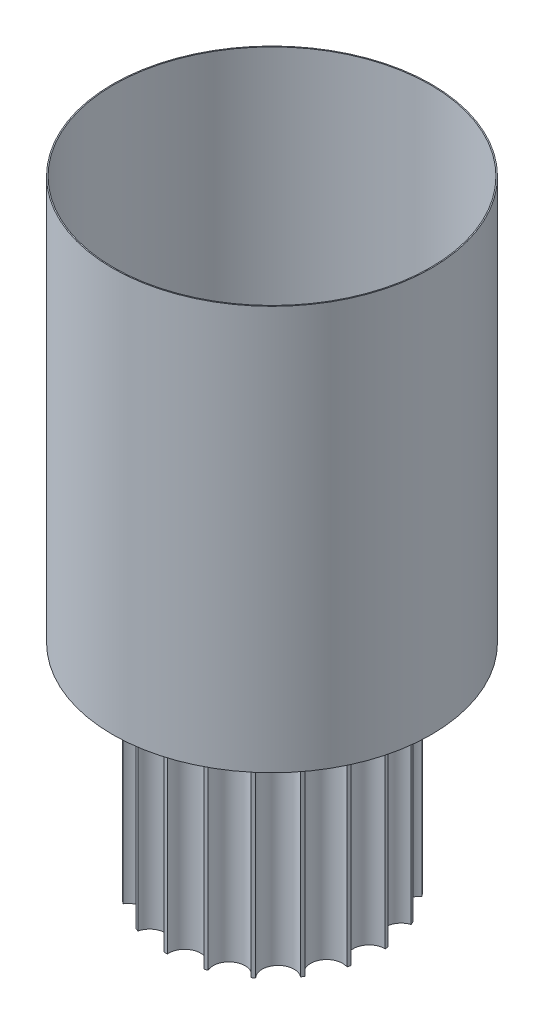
ISO-10303-21;
HEADER;
FILE_DESCRIPTION(('STEP AP214'),'2;1');
FILE_NAME('part.step','',(''),(''),'','','');
FILE_SCHEMA(('AUTOMOTIVE_DESIGN { 1 0 10303 214 1 1 1 1 }'));
ENDSEC;
DATA;
#1=APPLICATION_CONTEXT('core data for automotive mechanical design processes');
#2=APPLICATION_PROTOCOL_DEFINITION('international standard','automotive_design',2000,#1);
#3=PRODUCT_CONTEXT('',#1,'mechanical');
#4=PRODUCT('Part','Part','',(#3));
#5=PRODUCT_RELATED_PRODUCT_CATEGORY('part','',(#4));
#6=PRODUCT_DEFINITION_FORMATION('','',#4);
#7=PRODUCT_DEFINITION_CONTEXT('part definition',#1,'design');
#8=PRODUCT_DEFINITION('design','',#6,#7);
#9=PRODUCT_DEFINITION_SHAPE('','',#8);
#10=(LENGTH_UNIT() NAMED_UNIT(*) SI_UNIT(.MILLI.,.METRE.));
#11=(NAMED_UNIT(*) PLANE_ANGLE_UNIT() SI_UNIT($,.RADIAN.));
#12=(NAMED_UNIT(*) SI_UNIT($,.STERADIAN.) SOLID_ANGLE_UNIT());
#13=UNCERTAINTY_MEASURE_WITH_UNIT(LENGTH_MEASURE(1.E-05),#10,'distance_accuracy_value','');
#14=(GEOMETRIC_REPRESENTATION_CONTEXT(3) GLOBAL_UNCERTAINTY_ASSIGNED_CONTEXT((#13)) GLOBAL_UNIT_ASSIGNED_CONTEXT((#10,
#11,#12)) REPRESENTATION_CONTEXT('',''));
#15=CARTESIAN_POINT('',(0.,0.,0.));
#16=DIRECTION('',(0.,0.,1.));
#17=DIRECTION('',(1.,0.,0.));
#18=AXIS2_PLACEMENT_3D('',#15,#16,#17);
#19=CARTESIAN_POINT('',(47.5,-6.,-47.5));
#20=DIRECTION('',(0.,1.,0.));
#21=DIRECTION('',(0.,0.,1.));
#22=AXIS2_PLACEMENT_3D('',#19,#20,#21);
#23=CYLINDRICAL_SURFACE('',#22,5.);
#24=CARTESIAN_POINT('',(47.5,-6.,-47.5));
#25=DIRECTION('',(0.,-1.,0.));
#26=DIRECTION('',(0.,0.,-1.));
#27=AXIS2_PLACEMENT_3D('',#24,#25,#26);
#28=CIRCLE('',#27,5.);
#29=CARTESIAN_POINT('',(47.5,-6.,-52.5));
#30=VERTEX_POINT('',#29);
#31=EDGE_CURVE('E11',#30,#30,#28,.T.);
#32=ORIENTED_EDGE('',*,*,#31,.F.);
#33=EDGE_LOOP('',(#32));
#34=FACE_BOUND('',#33,.T.);
#35=CARTESIAN_POINT('',(47.5,-3.,-47.5));
#36=DIRECTION('',(0.,-1.,0.));
#37=DIRECTION('',(0.,0.,-1.));
#38=AXIS2_PLACEMENT_3D('',#35,#36,#37);
#39=CIRCLE('',#38,5.);
#40=CARTESIAN_POINT('',(47.5,-3.,-52.5));
#41=VERTEX_POINT('',#40);
#42=EDGE_CURVE('E43',#41,#41,#39,.T.);
#43=ORIENTED_EDGE('',*,*,#42,.T.);
#44=EDGE_LOOP('',(#43));
#45=FACE_BOUND('',#44,.T.);
#46=ADVANCED_FACE('F40',(#34,#45),#23,.T.);
#47=CARTESIAN_POINT('',(47.5,-6.,-47.5));
#48=DIRECTION('',(0.,-1.,0.));
#49=DIRECTION('',(0.,0.,-1.));
#50=AXIS2_PLACEMENT_3D('',#47,#48,#49);
#51=PLANE('',#50);
#52=ORIENTED_EDGE('',*,*,#31,.T.);
#53=EDGE_LOOP('',(#52));
#54=FACE_BOUND('',#53,.T.);
#55=ADVANCED_FACE('F55',(#54),#51,.T.);
#56=CARTESIAN_POINT('',(47.5,-3.,-47.5));
#57=DIRECTION('',(0.,-1.,0.));
#58=DIRECTION('',(0.,0.,-1.));
#59=AXIS2_PLACEMENT_3D('',#56,#57,#58);
#60=PLANE('',#59);
#61=ORIENTED_EDGE('',*,*,#42,.F.);
#62=EDGE_LOOP('',(#61));
#63=FACE_BOUND('',#62,.T.);
#64=ADVANCED_FACE('F53',(#63),#60,.F.);
#65=CLOSED_SHELL('',(#46,#55,#64));
#66=MANIFOLD_SOLID_BREP('B2',#65);
#67=CARTESIAN_POINT('',(-47.5,-6.,-47.5));
#68=DIRECTION('',(0.,1.,0.));
#69=DIRECTION('',(0.,0.,1.));
#70=AXIS2_PLACEMENT_3D('',#67,#68,#69);
#71=CYLINDRICAL_SURFACE('',#70,5.);
#72=CARTESIAN_POINT('',(-47.5,-6.,-47.5));
#73=DIRECTION('',(0.,-1.,0.));
#74=DIRECTION('',(0.,0.,-1.));
#75=AXIS2_PLACEMENT_3D('',#72,#73,#74);
#76=CIRCLE('',#75,5.);
#77=CARTESIAN_POINT('',(-47.5,-6.,-52.5));
#78=VERTEX_POINT('',#77);
#79=EDGE_CURVE('E39',#78,#78,#76,.T.);
#80=ORIENTED_EDGE('',*,*,#79,.F.);
#81=EDGE_LOOP('',(#80));
#82=FACE_BOUND('',#81,.T.);
#83=CARTESIAN_POINT('',(-47.5,-3.,-47.5));
#84=DIRECTION('',(0.,-1.,0.));
#85=DIRECTION('',(0.,0.,-1.));
#86=AXIS2_PLACEMENT_3D('',#83,#84,#85);
#87=CIRCLE('',#86,5.);
#88=CARTESIAN_POINT('',(-47.5,-3.,-52.5));
#89=VERTEX_POINT('',#88);
#90=EDGE_CURVE('E92',#89,#89,#87,.T.);
#91=ORIENTED_EDGE('',*,*,#90,.T.);
#92=EDGE_LOOP('',(#91));
#93=FACE_BOUND('',#92,.T.);
#94=ADVANCED_FACE('F89',(#82,#93),#71,.T.);
#95=CARTESIAN_POINT('',(-47.5,-6.,-47.5));
#96=DIRECTION('',(0.,-1.,0.));
#97=DIRECTION('',(0.,0.,-1.));
#98=AXIS2_PLACEMENT_3D('',#95,#96,#97);
#99=PLANE('',#98);
#100=ORIENTED_EDGE('',*,*,#79,.T.);
#101=EDGE_LOOP('',(#100));
#102=FACE_BOUND('',#101,.T.);
#103=ADVANCED_FACE('F104',(#102),#99,.T.);
#104=CARTESIAN_POINT('',(-47.5,-3.,-47.5));
#105=DIRECTION('',(0.,-1.,0.));
#106=DIRECTION('',(0.,0.,-1.));
#107=AXIS2_PLACEMENT_3D('',#104,#105,#106);
#108=PLANE('',#107);
#109=ORIENTED_EDGE('',*,*,#90,.F.);
#110=EDGE_LOOP('',(#109));
#111=FACE_BOUND('',#110,.T.);
#112=ADVANCED_FACE('F102',(#111),#108,.F.);
#113=CLOSED_SHELL('',(#94,#103,#112));
#114=MANIFOLD_SOLID_BREP('B6',#113);
#115=CARTESIAN_POINT('',(-47.5,-6.,47.5));
#116=DIRECTION('',(0.,1.,0.));
#117=DIRECTION('',(0.,0.,1.));
#118=AXIS2_PLACEMENT_3D('',#115,#116,#117);
#119=CYLINDRICAL_SURFACE('',#118,5.);
#120=CARTESIAN_POINT('',(-47.5,-6.,47.5));
#121=DIRECTION('',(0.,-1.,0.));
#122=DIRECTION('',(0.,0.,-1.));
#123=AXIS2_PLACEMENT_3D('',#120,#121,#122);
#124=CIRCLE('',#123,5.);
#125=CARTESIAN_POINT('',(-47.5,-6.,42.5));
#126=VERTEX_POINT('',#125);
#127=EDGE_CURVE('E88',#126,#126,#124,.T.);
#128=ORIENTED_EDGE('',*,*,#127,.F.);
#129=EDGE_LOOP('',(#128));
#130=FACE_BOUND('',#129,.T.);
#131=CARTESIAN_POINT('',(-47.5,-3.,47.5));
#132=DIRECTION('',(0.,-1.,0.));
#133=DIRECTION('',(0.,0.,-1.));
#134=AXIS2_PLACEMENT_3D('',#131,#132,#133);
#135=CIRCLE('',#134,5.);
#136=CARTESIAN_POINT('',(-47.5,-3.,42.5));
#137=VERTEX_POINT('',#136);
#138=EDGE_CURVE('E141',#137,#137,#135,.T.);
#139=ORIENTED_EDGE('',*,*,#138,.T.);
#140=EDGE_LOOP('',(#139));
#141=FACE_BOUND('',#140,.T.);
#142=ADVANCED_FACE('F138',(#130,#141),#119,.T.);
#143=CARTESIAN_POINT('',(-47.5,-6.,47.5));
#144=DIRECTION('',(0.,-1.,0.));
#145=DIRECTION('',(0.,0.,-1.));
#146=AXIS2_PLACEMENT_3D('',#143,#144,#145);
#147=PLANE('',#146);
#148=ORIENTED_EDGE('',*,*,#127,.T.);
#149=EDGE_LOOP('',(#148));
#150=FACE_BOUND('',#149,.T.);
#151=ADVANCED_FACE('F153',(#150),#147,.T.);
#152=CARTESIAN_POINT('',(-47.5,-3.,47.5));
#153=DIRECTION('',(0.,-1.,0.));
#154=DIRECTION('',(0.,0.,-1.));
#155=AXIS2_PLACEMENT_3D('',#152,#153,#154);
#156=PLANE('',#155);
#157=ORIENTED_EDGE('',*,*,#138,.F.);
#158=EDGE_LOOP('',(#157));
#159=FACE_BOUND('',#158,.T.);
#160=ADVANCED_FACE('F151',(#159),#156,.F.);
#161=CLOSED_SHELL('',(#142,#151,#160));
#162=MANIFOLD_SOLID_BREP('B34',#161);
#163=CARTESIAN_POINT('',(47.5,-6.,47.5));
#164=DIRECTION('',(0.,1.,0.));
#165=DIRECTION('',(0.,0.,1.));
#166=AXIS2_PLACEMENT_3D('',#163,#164,#165);
#167=CYLINDRICAL_SURFACE('',#166,5.);
#168=CARTESIAN_POINT('',(47.5,-6.,47.5));
#169=DIRECTION('',(0.,-1.,0.));
#170=DIRECTION('',(0.,0.,-1.));
#171=AXIS2_PLACEMENT_3D('',#168,#169,#170);
#172=CIRCLE('',#171,5.);
#173=CARTESIAN_POINT('',(47.5,-6.,42.5));
#174=VERTEX_POINT('',#173);
#175=EDGE_CURVE('E137',#174,#174,#172,.T.);
#176=ORIENTED_EDGE('',*,*,#175,.F.);
#177=EDGE_LOOP('',(#176));
#178=FACE_BOUND('',#177,.T.);
#179=CARTESIAN_POINT('',(47.5,-3.,47.5));
#180=DIRECTION('',(0.,-1.,0.));
#181=DIRECTION('',(0.,0.,-1.));
#182=AXIS2_PLACEMENT_3D('',#179,#180,#181);
#183=CIRCLE('',#182,5.);
#184=CARTESIAN_POINT('',(47.5,-3.,42.5));
#185=VERTEX_POINT('',#184);
#186=EDGE_CURVE('E190',#185,#185,#183,.T.);
#187=ORIENTED_EDGE('',*,*,#186,.T.);
#188=EDGE_LOOP('',(#187));
#189=FACE_BOUND('',#188,.T.);
#190=ADVANCED_FACE('F187',(#178,#189),#167,.T.);
#191=CARTESIAN_POINT('',(47.5,-6.,47.5));
#192=DIRECTION('',(0.,-1.,0.));
#193=DIRECTION('',(0.,0.,-1.));
#194=AXIS2_PLACEMENT_3D('',#191,#192,#193);
#195=PLANE('',#194);
#196=ORIENTED_EDGE('',*,*,#175,.T.);
#197=EDGE_LOOP('',(#196));
#198=FACE_BOUND('',#197,.T.);
#199=ADVANCED_FACE('F202',(#198),#195,.T.);
#200=CARTESIAN_POINT('',(47.5,-3.,47.5));
#201=DIRECTION('',(0.,-1.,0.));
#202=DIRECTION('',(0.,0.,-1.));
#203=AXIS2_PLACEMENT_3D('',#200,#201,#202);
#204=PLANE('',#203);
#205=ORIENTED_EDGE('',*,*,#186,.F.);
#206=EDGE_LOOP('',(#205));
#207=FACE_BOUND('',#206,.T.);
#208=ADVANCED_FACE('F200',(#207),#204,.F.);
#209=CLOSED_SHELL('',(#190,#199,#208));
#210=MANIFOLD_SOLID_BREP('B83',#209);
#211=CARTESIAN_POINT('',(0.,583.01,0.));
#212=DIRECTION('',(0.,1.,0.));
#213=DIRECTION('',(0.,0.,1.));
#214=AXIS2_PLACEMENT_3D('',#211,#212,#213);
#215=PLANE('',#214);
#216=CARTESIAN_POINT('',(0.,583.01,0.));
#217=DIRECTION('',(0.,1.,0.));
#218=DIRECTION('',(0.,0.,1.));
#219=AXIS2_PLACEMENT_3D('',#216,#217,#218);
#220=CIRCLE('',#219,150.);
#221=CARTESIAN_POINT('',(0.,583.01,150.));
#222=VERTEX_POINT('',#221);
#223=EDGE_CURVE('E186',#222,#222,#220,.T.);
#224=ORIENTED_EDGE('',*,*,#223,.T.);
#225=EDGE_LOOP('',(#224));
#226=FACE_BOUND('',#225,.T.);
#227=CARTESIAN_POINT('',(0.,583.01,0.));
#228=DIRECTION('',(0.,1.,0.));
#229=DIRECTION('',(0.,0.,1.));
#230=AXIS2_PLACEMENT_3D('',#227,#228,#229);
#231=CIRCLE('',#230,149.);
#232=CARTESIAN_POINT('',(0.,583.01,149.));
#233=VERTEX_POINT('',#232);
#234=EDGE_CURVE('E247',#233,#233,#231,.T.);
#235=ORIENTED_EDGE('',*,*,#234,.F.);
#236=EDGE_LOOP('',(#235));
#237=FACE_BOUND('',#236,.T.);
#238=ADVANCED_FACE('F236',(#226,#237),#215,.T.);
#239=CARTESIAN_POINT('',(0.,203.01,0.));
#240=DIRECTION('',(0.,1.,0.));
#241=DIRECTION('',(0.,0.,1.));
#242=AXIS2_PLACEMENT_3D('',#239,#240,#241);
#243=PLANE('',#242);
#244=CARTESIAN_POINT('',(0.,203.01,0.));
#245=DIRECTION('',(0.,1.,0.));
#246=DIRECTION('',(0.,0.,1.));
#247=AXIS2_PLACEMENT_3D('',#244,#245,#246);
#248=CIRCLE('',#247,150.);
#249=CARTESIAN_POINT('',(0.,203.01,150.));
#250=VERTEX_POINT('',#249);
#251=EDGE_CURVE('E240',#250,#250,#248,.T.);
#252=ORIENTED_EDGE('',*,*,#251,.F.);
#253=EDGE_LOOP('',(#252));
#254=FACE_BOUND('',#253,.T.);
#255=CARTESIAN_POINT('',(0.,203.01,0.));
#256=DIRECTION('',(0.,1.,0.));
#257=DIRECTION('',(0.,0.,1.));
#258=AXIS2_PLACEMENT_3D('',#255,#256,#257);
#259=CIRCLE('',#258,149.);
#260=CARTESIAN_POINT('',(0.,203.01,149.));
#261=VERTEX_POINT('',#260);
#262=EDGE_CURVE('E249',#261,#261,#259,.T.);
#263=ORIENTED_EDGE('',*,*,#262,.T.);
#264=EDGE_LOOP('',(#263));
#265=FACE_BOUND('',#264,.T.);
#266=ADVANCED_FACE('F259',(#254,#265),#243,.F.);
#267=CARTESIAN_POINT('',(0.,583.01,0.));
#268=DIRECTION('',(0.,-1.,0.));
#269=DIRECTION('',(0.,0.,-1.));
#270=AXIS2_PLACEMENT_3D('',#267,#268,#269);
#271=CYLINDRICAL_SURFACE('',#270,150.);
#272=ORIENTED_EDGE('',*,*,#223,.F.);
#273=EDGE_LOOP('',(#272));
#274=FACE_BOUND('',#273,.T.);
#275=ORIENTED_EDGE('',*,*,#251,.T.);
#276=EDGE_LOOP('',(#275));
#277=FACE_BOUND('',#276,.T.);
#278=ADVANCED_FACE('F238',(#274,#277),#271,.T.);
#279=CARTESIAN_POINT('',(0.,583.01,0.));
#280=DIRECTION('',(0.,-1.,0.));
#281=DIRECTION('',(0.,0.,-1.));
#282=AXIS2_PLACEMENT_3D('',#279,#280,#281);
#283=CYLINDRICAL_SURFACE('',#282,149.);
#284=ORIENTED_EDGE('',*,*,#234,.T.);
#285=EDGE_LOOP('',(#284));
#286=FACE_BOUND('',#285,.T.);
#287=ORIENTED_EDGE('',*,*,#262,.F.);
#288=EDGE_LOOP('',(#287));
#289=FACE_BOUND('',#288,.T.);
#290=ADVANCED_FACE('F255',(#286,#289),#283,.F.);
#291=CLOSED_SHELL('',(#238,#266,#278,#290));
#292=MANIFOLD_SOLID_BREP('B132',#291);
#293=CARTESIAN_POINT('',(0.,203.,0.));
#294=DIRECTION('',(0.,-1.,0.));
#295=DIRECTION('',(0.,0.,-1.));
#296=AXIS2_PLACEMENT_3D('',#293,#294,#295);
#297=CYLINDRICAL_SURFACE('',#296,100.);
#298=CARTESIAN_POINT('',(0.,203.,0.));
#299=DIRECTION('',(0.,1.,0.));
#300=DIRECTION('',(0.,0.,1.));
#301=AXIS2_PLACEMENT_3D('',#298,#299,#300);
#302=CIRCLE('',#301,100.);
#303=CARTESIAN_POINT('',(0.,203.,100.));
#304=VERTEX_POINT('',#303);
#305=EDGE_CURVE('E235',#304,#304,#302,.T.);
#306=ORIENTED_EDGE('',*,*,#305,.F.);
#307=EDGE_LOOP('',(#306));
#308=FACE_BOUND('',#307,.T.);
#309=CARTESIAN_POINT('',(0.,200.,0.));
#310=DIRECTION('',(0.,1.,0.));
#311=DIRECTION('',(0.,0.,1.));
#312=AXIS2_PLACEMENT_3D('',#309,#310,#311);
#313=CIRCLE('',#312,100.);
#314=CARTESIAN_POINT('',(0.,200.,100.));
#315=VERTEX_POINT('',#314);
#316=EDGE_CURVE('E309',#315,#315,#313,.T.);
#317=ORIENTED_EDGE('',*,*,#316,.T.);
#318=EDGE_LOOP('',(#317));
#319=FACE_BOUND('',#318,.T.);
#320=ADVANCED_FACE('F306',(#308,#319),#297,.T.);
#321=CARTESIAN_POINT('',(0.,203.,0.));
#322=DIRECTION('',(0.,1.,0.));
#323=DIRECTION('',(0.,0.,1.));
#324=AXIS2_PLACEMENT_3D('',#321,#322,#323);
#325=PLANE('',#324);
#326=CARTESIAN_POINT('',(0.,203.,0.));
#327=DIRECTION('',(0.,1.,0.));
#328=DIRECTION('',(0.,0.,1.));
#329=AXIS2_PLACEMENT_3D('',#326,#327,#328);
#330=CIRCLE('',#329,10.);
#331=CARTESIAN_POINT('',(0.,203.,-10.));
#332=VERTEX_POINT('',#331);
#333=EDGE_CURVE('E318',#332,#332,#330,.T.);
#334=ORIENTED_EDGE('',*,*,#333,.F.);
#335=EDGE_LOOP('',(#334));
#336=FACE_BOUND('',#335,.T.);
#337=ORIENTED_EDGE('',*,*,#305,.T.);
#338=EDGE_LOOP('',(#337));
#339=FACE_BOUND('',#338,.T.);
#340=ADVANCED_FACE('F333',(#336,#339),#325,.T.);
#341=CARTESIAN_POINT('',(0.,200.,0.));
#342=DIRECTION('',(0.,1.,0.));
#343=DIRECTION('',(0.,0.,1.));
#344=AXIS2_PLACEMENT_3D('',#341,#342,#343);
#345=PLANE('',#344);
#346=ORIENTED_EDGE('',*,*,#316,.F.);
#347=EDGE_LOOP('',(#346));
#348=FACE_BOUND('',#347,.T.);
#349=ADVANCED_FACE('F329',(#348),#345,.F.);
#350=CARTESIAN_POINT('',(0.,203.01,0.));
#351=DIRECTION('',(0.,-1.,0.));
#352=DIRECTION('',(0.,0.,-1.));
#353=AXIS2_PLACEMENT_3D('',#350,#351,#352);
#354=CYLINDRICAL_SURFACE('',#353,10.);
#355=CARTESIAN_POINT('',(0.,203.01,0.));
#356=DIRECTION('',(0.,1.,0.));
#357=DIRECTION('',(0.,0.,1.));
#358=AXIS2_PLACEMENT_3D('',#355,#356,#357);
#359=CIRCLE('',#358,10.);
#360=CARTESIAN_POINT('',(0.,203.01,-10.));
#361=VERTEX_POINT('',#360);
#362=EDGE_CURVE('E316',#361,#361,#359,.T.);
#363=CARTESIAN_POINT('',(0.,203.01,-10.));
#364=CARTESIAN_POINT('',(0.,203.009895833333,-10.));
#365=CARTESIAN_POINT('',(0.,203.009791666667,-10.));
#366=CARTESIAN_POINT('',(0.,203.009583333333,-10.));
#367=CARTESIAN_POINT('',(0.,203.009479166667,-10.));
#368=CARTESIAN_POINT('',(0.,203.009270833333,-10.));
#369=CARTESIAN_POINT('',(0.,203.009166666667,-10.));
#370=CARTESIAN_POINT('',(0.,203.008958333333,-10.));
#371=CARTESIAN_POINT('',(0.,203.008854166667,-10.));
#372=CARTESIAN_POINT('',(0.,203.008645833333,-10.));
#373=CARTESIAN_POINT('',(0.,203.008541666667,-10.));
#374=CARTESIAN_POINT('',(0.,203.008333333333,-10.));
#375=CARTESIAN_POINT('',(0.,203.008229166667,-10.));
#376=CARTESIAN_POINT('',(0.,203.008020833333,-10.));
#377=CARTESIAN_POINT('',(0.,203.007916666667,-10.));
#378=CARTESIAN_POINT('',(0.,203.007708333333,-10.));
#379=CARTESIAN_POINT('',(0.,203.007604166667,-10.));
#380=CARTESIAN_POINT('',(0.,203.007395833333,-10.));
#381=CARTESIAN_POINT('',(0.,203.007291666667,-10.));
#382=CARTESIAN_POINT('',(0.,203.007083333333,-10.));
#383=CARTESIAN_POINT('',(0.,203.006979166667,-10.));
#384=CARTESIAN_POINT('',(0.,203.006770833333,-10.));
#385=CARTESIAN_POINT('',(0.,203.006666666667,-10.));
#386=CARTESIAN_POINT('',(0.,203.006458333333,-10.));
#387=CARTESIAN_POINT('',(0.,203.006354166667,-10.));
#388=CARTESIAN_POINT('',(0.,203.006145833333,-10.));
#389=CARTESIAN_POINT('',(0.,203.006041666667,-10.));
#390=CARTESIAN_POINT('',(0.,203.005833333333,-10.));
#391=CARTESIAN_POINT('',(0.,203.005729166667,-10.));
#392=CARTESIAN_POINT('',(0.,203.005520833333,-10.));
#393=CARTESIAN_POINT('',(0.,203.005416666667,-10.));
#394=CARTESIAN_POINT('',(0.,203.005208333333,-10.));
#395=CARTESIAN_POINT('',(0.,203.005104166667,-10.));
#396=CARTESIAN_POINT('',(0.,203.004895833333,-10.));
#397=CARTESIAN_POINT('',(0.,203.004791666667,-10.));
#398=CARTESIAN_POINT('',(0.,203.004583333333,-10.));
#399=CARTESIAN_POINT('',(0.,203.004479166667,-10.));
#400=CARTESIAN_POINT('',(0.,203.004270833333,-10.));
#401=CARTESIAN_POINT('',(0.,203.004166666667,-10.));
#402=CARTESIAN_POINT('',(0.,203.003958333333,-10.));
#403=CARTESIAN_POINT('',(0.,203.003854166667,-10.));
#404=CARTESIAN_POINT('',(0.,203.003645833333,-10.));
#405=CARTESIAN_POINT('',(0.,203.003541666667,-10.));
#406=CARTESIAN_POINT('',(0.,203.003333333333,-10.));
#407=CARTESIAN_POINT('',(0.,203.003229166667,-10.));
#408=CARTESIAN_POINT('',(0.,203.003020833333,-10.));
#409=CARTESIAN_POINT('',(0.,203.002916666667,-10.));
#410=CARTESIAN_POINT('',(0.,203.002708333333,-10.));
#411=CARTESIAN_POINT('',(0.,203.002604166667,-10.));
#412=CARTESIAN_POINT('',(0.,203.002395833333,-10.));
#413=CARTESIAN_POINT('',(0.,203.002291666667,-10.));
#414=CARTESIAN_POINT('',(0.,203.002083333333,-10.));
#415=CARTESIAN_POINT('',(0.,203.001979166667,-10.));
#416=CARTESIAN_POINT('',(0.,203.001770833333,-10.));
#417=CARTESIAN_POINT('',(0.,203.001666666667,-10.));
#418=CARTESIAN_POINT('',(0.,203.001458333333,-10.));
#419=CARTESIAN_POINT('',(0.,203.001354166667,-10.));
#420=CARTESIAN_POINT('',(0.,203.001145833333,-10.));
#421=CARTESIAN_POINT('',(0.,203.001041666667,-10.));
#422=CARTESIAN_POINT('',(0.,203.000833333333,-10.));
#423=CARTESIAN_POINT('',(0.,203.000729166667,-10.));
#424=CARTESIAN_POINT('',(0.,203.000520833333,-10.));
#425=CARTESIAN_POINT('',(0.,203.000416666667,-10.));
#426=CARTESIAN_POINT('',(0.,203.000208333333,-10.));
#427=CARTESIAN_POINT('',(0.,203.000104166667,-10.));
#428=CARTESIAN_POINT('',(0.,203.,-10.));
#429=B_SPLINE_CURVE_WITH_KNOTS('',3,(#363,#364,#365,#366,#367,#368,#369,#370,#371,#372,#373,
#374,#375,#376,#377,#378,#379,#380,#381,#382,#383,#384,#385,#386,#387,#388,#389,#390,#391,#392,
#393,#394,#395,#396,#397,#398,#399,#400,#401,#402,#403,#404,#405,#406,#407,#408,#409,#410,#411,
#412,#413,#414,#415,#416,#417,#418,#419,#420,#421,#422,#423,#424,#425,#426,#427,#428),
.UNSPECIFIED.,.F.,.F.,(4,2,2,2,2,2,2,2,2,2,2,2,2,2,2,2,2,2,2,2,2,2,2,2,2,2,2,2,2,2,2,2,4),(0.,
0.000312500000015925,0.000625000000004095,0.00093750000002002,0.00125000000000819,
0.00156250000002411,0.00187500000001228,0.00218750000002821,0.00250000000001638,
0.00281250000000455,0.00312500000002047,0.00343750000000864,0.00375000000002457,
0.00406250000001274,0.00437500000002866,0.00468750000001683,0.00500000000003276,
0.00531250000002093,0.00562500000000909,0.00593750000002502,0.00625000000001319,
0.00656250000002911,0.00687500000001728,0.00718750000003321,0.00750000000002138,
0.00781250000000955,0.00812500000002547,0.00843750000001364,0.00875000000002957,
0.00906250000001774,0.00937500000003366,0.00968750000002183,0.0100000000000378),.UNSPECIFIED.);
#430=EDGE_CURVE('BSEAM326',#361,#332,#429,.T.);
#431=ORIENTED_EDGE('',*,*,#362,.F.);
#432=ORIENTED_EDGE('',*,*,#333,.T.);
#433=ORIENTED_EDGE('',*,*,#430,.T.);
#434=ORIENTED_EDGE('',*,*,#430,.F.);
#435=EDGE_LOOP('',(#431,#433,#432,#434));
#436=FACE_BOUND('',#435,.T.);
#437=ADVANCED_FACE('F326',(#436),#354,.T.);
#438=CARTESIAN_POINT('',(0.,203.01,0.));
#439=DIRECTION('',(0.,1.,0.));
#440=DIRECTION('',(0.,0.,1.));
#441=AXIS2_PLACEMENT_3D('',#438,#439,#440);
#442=PLANE('',#441);
#443=ORIENTED_EDGE('',*,*,#362,.T.);
#444=EDGE_LOOP('',(#443));
#445=FACE_BOUND('',#444,.T.);
#446=ADVANCED_FACE('F324',(#445),#442,.T.);
#447=CLOSED_SHELL('',(#320,#340,#349,#437,#446));
#448=MANIFOLD_SOLID_BREP('B181',#447);
#449=CARTESIAN_POINT('',(0.,-3.,0.));
#450=DIRECTION('',(0.,1.,0.));
#451=DIRECTION('',(0.,0.,1.));
#452=AXIS2_PLACEMENT_3D('',#449,#450,#451);
#453=CYLINDRICAL_SURFACE('',#452,80.);
#454=CARTESIAN_POINT('',(0.,-3.,0.));
#455=DIRECTION('',(0.,-1.,0.));
#456=DIRECTION('',(0.,0.,-1.));
#457=AXIS2_PLACEMENT_3D('',#454,#455,#456);
#458=CIRCLE('',#457,80.);
#459=CARTESIAN_POINT('',(0.,-3.,-80.));
#460=VERTEX_POINT('',#459);
#461=EDGE_CURVE('E305',#460,#460,#458,.T.);
#462=ORIENTED_EDGE('',*,*,#461,.F.);
#463=EDGE_LOOP('',(#462));
#464=FACE_BOUND('',#463,.T.);
#465=CARTESIAN_POINT('',(0.,0.,0.));
#466=DIRECTION('',(0.,-1.,0.));
#467=DIRECTION('',(0.,0.,-1.));
#468=AXIS2_PLACEMENT_3D('',#465,#466,#467);
#469=CIRCLE('',#468,80.);
#470=CARTESIAN_POINT('',(0.,0.,-80.));
#471=VERTEX_POINT('',#470);
#472=EDGE_CURVE('E389',#471,#471,#469,.T.);
#473=ORIENTED_EDGE('',*,*,#472,.T.);
#474=EDGE_LOOP('',(#473));
#475=FACE_BOUND('',#474,.T.);
#476=ADVANCED_FACE('F386',(#464,#475),#453,.T.);
#477=CARTESIAN_POINT('',(0.,-3.,0.));
#478=DIRECTION('',(0.,-1.,0.));
#479=DIRECTION('',(0.,0.,-1.));
#480=AXIS2_PLACEMENT_3D('',#477,#478,#479);
#481=PLANE('',#480);
#482=ORIENTED_EDGE('',*,*,#461,.T.);
#483=EDGE_LOOP('',(#482));
#484=FACE_BOUND('',#483,.T.);
#485=ADVANCED_FACE('F401',(#484),#481,.T.);
#486=CARTESIAN_POINT('',(0.,0.,0.));
#487=DIRECTION('',(0.,-1.,0.));
#488=DIRECTION('',(0.,0.,-1.));
#489=AXIS2_PLACEMENT_3D('',#486,#487,#488);
#490=PLANE('',#489);
#491=ORIENTED_EDGE('',*,*,#472,.F.);
#492=EDGE_LOOP('',(#491));
#493=FACE_BOUND('',#492,.T.);
#494=ADVANCED_FACE('F399',(#493),#490,.F.);
#495=CLOSED_SHELL('',(#476,#485,#494));
#496=MANIFOLD_SOLID_BREP('B230',#495);
#497=CARTESIAN_POINT('',(0.,200.,0.));
#498=DIRECTION('',(0.,-1.,0.));
#499=DIRECTION('',(0.,0.,-1.));
#500=AXIS2_PLACEMENT_3D('',#497,#498,#499);
#501=CYLINDRICAL_SURFACE('',#500,100.);
#502=CARTESIAN_POINT('',(0.,0.,0.));
#503=DIRECTION('',(0.,1.,0.));
#504=DIRECTION('',(0.,0.,1.));
#505=AXIS2_PLACEMENT_3D('',#502,#503,#504);
#506=CIRCLE('',#505,100.);
#507=CARTESIAN_POINT('',(-1.52054136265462,0.,99.9884391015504));
#508=VERTEX_POINT('',#507);
#509=CARTESIAN_POINT('',(1.52054136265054,0.,99.9884391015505));
#510=VERTEX_POINT('',#509);
#511=EDGE_CURVE('E705',#508,#510,#506,.T.);
#512=ORIENTED_EDGE('',*,*,#511,.T.);
#513=DIRECTION('',(0.,1.,0.));
#514=VECTOR('',#513,1.);
#515=CARTESIAN_POINT('',(1.52054136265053,100.,99.9884391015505));
#516=LINE('',#515,#514);
#517=CARTESIAN_POINT('',(1.52054136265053,200.,99.9884391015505));
#518=VERTEX_POINT('',#517);
#519=EDGE_CURVE('E709',#510,#518,#516,.T.);
#520=ORIENTED_EDGE('',*,*,#519,.T.);
#521=CARTESIAN_POINT('',(0.,200.,0.));
#522=DIRECTION('',(0.,1.,0.));
#523=DIRECTION('',(0.,0.,1.));
#524=AXIS2_PLACEMENT_3D('',#521,#522,#523);
#525=CIRCLE('',#524,100.);
#526=CARTESIAN_POINT('',(-1.52054136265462,200.,99.9884391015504));
#527=VERTEX_POINT('',#526);
#528=EDGE_CURVE('E711',#527,#518,#525,.T.);
#529=ORIENTED_EDGE('',*,*,#528,.F.);
#530=DIRECTION('',(0.,1.,0.));
#531=VECTOR('',#530,1.);
#532=CARTESIAN_POINT('',(-1.52054136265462,100.,99.9884391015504));
#533=LINE('',#532,#531);
#534=EDGE_CURVE('E923',#527,#508,#533,.F.);
#535=ORIENTED_EDGE('',*,*,#534,.T.);
#536=EDGE_LOOP('',(#512,#520,#529,#535));
#537=FACE_BOUND('',#536,.T.);
#538=ADVANCED_FACE('F426',(#537),#501,.T.);
#539=CARTESIAN_POINT('',(-33.9043473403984,0.,94.0770706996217));
#540=VERTEX_POINT('',#539);
#541=CARTESIAN_POINT('',(-31.0280388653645,0.,95.0645086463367));
#542=VERTEX_POINT('',#541);
#543=EDGE_CURVE('E708',#540,#542,#506,.T.);
#544=ORIENTED_EDGE('',*,*,#543,.T.);
#545=DIRECTION('',(0.,1.,0.));
#546=VECTOR('',#545,1.);
#547=CARTESIAN_POINT('',(-31.0280388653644,100.,95.0645086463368));
#548=LINE('',#547,#546);
#549=CARTESIAN_POINT('',(-31.0280388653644,200.,95.0645086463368));
#550=VERTEX_POINT('',#549);
#551=EDGE_CURVE('E441',#542,#550,#548,.T.);
#552=ORIENTED_EDGE('',*,*,#551,.T.);
#553=CARTESIAN_POINT('',(-33.9043473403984,200.,94.0770706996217));
#554=VERTEX_POINT('',#553);
#555=EDGE_CURVE('E808',#554,#550,#525,.T.);
#556=ORIENTED_EDGE('',*,*,#555,.F.);
#557=DIRECTION('',(0.,1.,0.));
#558=VECTOR('',#557,1.);
#559=CARTESIAN_POINT('',(-33.9043473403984,100.,94.0770706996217));
#560=LINE('',#559,#558);
#561=EDGE_CURVE('E913',#554,#540,#560,.F.);
#562=ORIENTED_EDGE('',*,*,#561,.T.);
#563=EDGE_LOOP('',(#544,#552,#556,#562));
#564=FACE_BOUND('',#563,.T.);
#565=ADVANCED_FACE('F751',(#564),#501,.T.);
#566=CARTESIAN_POINT('',(-84.5386267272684,0.,53.4155463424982));
#567=VERTEX_POINT('',#566);
#568=CARTESIAN_POINT('',(-82.8753121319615,0.,55.9614388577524));
#569=VERTEX_POINT('',#568);
#570=EDGE_CURVE('E1129',#567,#569,#506,.T.);
#571=ORIENTED_EDGE('',*,*,#570,.T.);
#572=DIRECTION('',(0.,1.,0.));
#573=VECTOR('',#572,1.);
#574=CARTESIAN_POINT('',(-82.8753121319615,100.,55.9614388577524));
#575=LINE('',#574,#573);
#576=CARTESIAN_POINT('',(-82.8753121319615,200.,55.9614388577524));
#577=VERTEX_POINT('',#576);
#578=EDGE_CURVE('E920',#569,#577,#575,.T.);
#579=ORIENTED_EDGE('',*,*,#578,.T.);
#580=CARTESIAN_POINT('',(-84.5386267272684,200.,53.4155463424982));
#581=VERTEX_POINT('',#580);
#582=EDGE_CURVE('E800',#581,#577,#525,.T.);
#583=ORIENTED_EDGE('',*,*,#582,.F.);
#584=DIRECTION('',(0.,1.,0.));
#585=VECTOR('',#584,1.);
#586=CARTESIAN_POINT('',(-84.5386267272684,100.,53.4155463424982));
#587=LINE('',#586,#585);
#588=EDGE_CURVE('E907',#581,#567,#587,.F.);
#589=ORIENTED_EDGE('',*,*,#588,.T.);
#590=EDGE_LOOP('',(#571,#579,#583,#589));
#591=FACE_BOUND('',#590,.T.);
#592=ADVANCED_FACE('F757',(#591),#501,.T.);
#593=CARTESIAN_POINT('',(-62.6140912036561,200.,77.970991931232));
#594=VERTEX_POINT('',#593);
#595=CARTESIAN_POINT('',(-60.2142496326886,200.,79.8388636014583));
#596=VERTEX_POINT('',#595);
#597=EDGE_CURVE('E804',#594,#596,#525,.T.);
#598=ORIENTED_EDGE('',*,*,#597,.F.);
#599=DIRECTION('',(0.,1.,0.));
#600=VECTOR('',#599,1.);
#601=CARTESIAN_POINT('',(-62.6140912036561,100.,77.970991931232));
#602=LINE('',#601,#600);
#603=CARTESIAN_POINT('',(-62.6140912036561,0.,77.970991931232));
#604=VERTEX_POINT('',#603);
#605=EDGE_CURVE('E917',#594,#604,#602,.F.);
#606=ORIENTED_EDGE('',*,*,#605,.T.);
#607=CARTESIAN_POINT('',(-60.2142496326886,0.,79.8388636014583));
#608=VERTEX_POINT('',#607);
#609=EDGE_CURVE('E1133',#604,#608,#506,.T.);
#610=ORIENTED_EDGE('',*,*,#609,.T.);
#611=DIRECTION('',(0.,1.,0.));
#612=VECTOR('',#611,1.);
#613=CARTESIAN_POINT('',(-60.2142496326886,100.,79.8388636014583));
#614=LINE('',#613,#612);
#615=EDGE_CURVE('E449',#608,#596,#614,.T.);
#616=ORIENTED_EDGE('',*,*,#615,.T.);
#617=EDGE_LOOP('',(#598,#606,#610,#616));
#618=FACE_BOUND('',#617,.T.);
#619=ADVANCED_FACE('F1286',(#618),#501,.T.);
#620=CARTESIAN_POINT('',(-97.3020902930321,0.,23.0716974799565));
#621=VERTEX_POINT('',#620);
#622=CARTESIAN_POINT('',(-96.5555486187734,0.,26.019723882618));
#623=VERTEX_POINT('',#622);
#624=EDGE_CURVE('E1125',#621,#623,#506,.T.);
#625=ORIENTED_EDGE('',*,*,#624,.T.);
#626=DIRECTION('',(0.,1.,0.));
#627=VECTOR('',#626,1.);
#628=CARTESIAN_POINT('',(-96.5555486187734,100.,26.0197238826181));
#629=LINE('',#628,#627);
#630=CARTESIAN_POINT('',(-96.5555486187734,200.,26.0197238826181));
#631=VERTEX_POINT('',#630);
#632=EDGE_CURVE('E910',#623,#631,#629,.T.);
#633=ORIENTED_EDGE('',*,*,#632,.T.);
#634=CARTESIAN_POINT('',(-97.3020902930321,200.,23.0716974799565));
#635=VERTEX_POINT('',#634);
#636=EDGE_CURVE('E796',#635,#631,#525,.T.);
#637=ORIENTED_EDGE('',*,*,#636,.F.);
#638=DIRECTION('',(0.,1.,0.));
#639=VECTOR('',#638,1.);
#640=CARTESIAN_POINT('',(-97.3020902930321,100.,23.0716974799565));
#641=LINE('',#640,#639);
#642=EDGE_CURVE('E901',#635,#621,#641,.F.);
#643=ORIENTED_EDGE('',*,*,#642,.T.);
#644=EDGE_LOOP('',(#625,#633,#637,#643));
#645=FACE_BOUND('',#644,.T.);
#646=ADVANCED_FACE('F1278',(#645),#501,.T.);
#647=CARTESIAN_POINT('',(-99.5213625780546,0.,-9.77232779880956));
#648=VERTEX_POINT('',#647);
#649=CARTESIAN_POINT('',(-99.7724931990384,0.,-6.74163191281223));
#650=VERTEX_POINT('',#649);
#651=EDGE_CURVE('E1121',#648,#650,#506,.T.);
#652=ORIENTED_EDGE('',*,*,#651,.T.);
#653=DIRECTION('',(0.,1.,0.));
#654=VECTOR('',#653,1.);
#655=CARTESIAN_POINT('',(-99.7724931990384,100.,-6.74163191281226));
#656=LINE('',#655,#654);
#657=CARTESIAN_POINT('',(-99.7724931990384,200.,-6.74163191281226));
#658=VERTEX_POINT('',#657);
#659=EDGE_CURVE('E904',#650,#658,#656,.T.);
#660=ORIENTED_EDGE('',*,*,#659,.T.);
#661=CARTESIAN_POINT('',(-99.5213625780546,200.,-9.77232779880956));
#662=VERTEX_POINT('',#661);
#663=EDGE_CURVE('E792',#662,#658,#525,.T.);
#664=ORIENTED_EDGE('',*,*,#663,.F.);
#665=DIRECTION('',(0.,1.,0.));
#666=VECTOR('',#665,1.);
#667=CARTESIAN_POINT('',(-99.5213625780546,100.,-9.77232779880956));
#668=LINE('',#667,#666);
#669=EDGE_CURVE('E895',#662,#648,#668,.F.);
#670=ORIENTED_EDGE('',*,*,#669,.T.);
#671=EDGE_LOOP('',(#652,#660,#664,#670));
#672=FACE_BOUND('',#671,.T.);
#673=ADVANCED_FACE('F1270',(#672),#501,.T.);
#674=CARTESIAN_POINT('',(-90.9559509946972,0.,-41.5573697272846));
#675=VERTEX_POINT('',#674);
#676=CARTESIAN_POINT('',(-92.1775400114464,0.,-38.7724272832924));
#677=VERTEX_POINT('',#676);
#678=EDGE_CURVE('E1119',#675,#677,#506,.T.);
#679=ORIENTED_EDGE('',*,*,#678,.T.);
#680=DIRECTION('',(0.,1.,0.));
#681=VECTOR('',#680,1.);
#682=CARTESIAN_POINT('',(-92.1775400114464,100.,-38.7724272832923));
#683=LINE('',#682,#681);
#684=CARTESIAN_POINT('',(-92.1775400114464,200.,-38.7724272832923));
#685=VERTEX_POINT('',#684);
#686=EDGE_CURVE('E898',#677,#685,#683,.T.);
#687=ORIENTED_EDGE('',*,*,#686,.T.);
#688=CARTESIAN_POINT('',(-90.9559509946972,200.,-41.5573697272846));
#689=VERTEX_POINT('',#688);
#690=EDGE_CURVE('E788',#689,#685,#525,.T.);
#691=ORIENTED_EDGE('',*,*,#690,.F.);
#692=DIRECTION('',(0.,1.,0.));
#693=VECTOR('',#692,1.);
#694=CARTESIAN_POINT('',(-90.9559509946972,100.,-41.5573697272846));
#695=LINE('',#694,#693);
#696=EDGE_CURVE('E889',#689,#675,#695,.F.);
#697=ORIENTED_EDGE('',*,*,#696,.T.);
#698=EDGE_LOOP('',(#679,#687,#691,#697));
#699=FACE_BOUND('',#698,.T.);
#700=ADVANCED_FACE('F1262',(#699),#501,.T.);
#701=CARTESIAN_POINT('',(-72.5340507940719,0.,-68.8390258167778));
#702=VERTEX_POINT('',#701);
#703=CARTESIAN_POINT('',(-74.5937200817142,0.,-66.6016285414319));
#704=VERTEX_POINT('',#703);
#705=EDGE_CURVE('E704',#702,#704,#506,.T.);
#706=ORIENTED_EDGE('',*,*,#705,.T.);
#707=DIRECTION('',(0.,1.,0.));
#708=VECTOR('',#707,1.);
#709=CARTESIAN_POINT('',(-74.5937200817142,100.,-66.6016285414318));
#710=LINE('',#709,#708);
#711=CARTESIAN_POINT('',(-74.5937200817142,200.,-66.6016285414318));
#712=VERTEX_POINT('',#711);
#713=EDGE_CURVE('E892',#704,#712,#710,.T.);
#714=ORIENTED_EDGE('',*,*,#713,.T.);
#715=CARTESIAN_POINT('',(-72.5340507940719,200.,-68.8390258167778));
#716=VERTEX_POINT('',#715);
#717=EDGE_CURVE('E784',#716,#712,#525,.T.);
#718=ORIENTED_EDGE('',*,*,#717,.F.);
#719=DIRECTION('',(0.,1.,0.));
#720=VECTOR('',#719,1.);
#721=CARTESIAN_POINT('',(-72.5340507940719,100.,-68.8390258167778));
#722=LINE('',#721,#720);
#723=EDGE_CURVE('E984',#716,#702,#722,.F.);
#724=ORIENTED_EDGE('',*,*,#723,.T.);
#725=EDGE_LOOP('',(#706,#714,#718,#724));
#726=FACE_BOUND('',#725,.T.);
#727=ADVANCED_FACE('F1117',(#726),#501,.T.);
#728=CARTESIAN_POINT('',(96.5555486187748,0.,26.019723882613));
#729=VERTEX_POINT('',#728);
#730=CARTESIAN_POINT('',(97.30209029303,0.,23.0716974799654));
#731=VERTEX_POINT('',#730);
#732=EDGE_CURVE('E1018',#729,#731,#506,.T.);
#733=ORIENTED_EDGE('',*,*,#732,.T.);
#734=DIRECTION('',(0.,1.,0.));
#735=VECTOR('',#734,1.);
#736=CARTESIAN_POINT('',(97.30209029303,100.,23.0716974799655));
#737=LINE('',#736,#735);
#738=CARTESIAN_POINT('',(97.30209029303,200.,23.0716974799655));
#739=VERTEX_POINT('',#738);
#740=EDGE_CURVE('E886',#731,#739,#737,.T.);
#741=ORIENTED_EDGE('',*,*,#740,.T.);
#742=CARTESIAN_POINT('',(96.5555486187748,200.,26.019723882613));
#743=VERTEX_POINT('',#742);
#744=EDGE_CURVE('E828',#743,#739,#525,.T.);
#745=ORIENTED_EDGE('',*,*,#744,.F.);
#746=DIRECTION('',(0.,1.,0.));
#747=VECTOR('',#746,1.);
#748=CARTESIAN_POINT('',(96.5555486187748,100.,26.0197238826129));
#749=LINE('',#748,#747);
#750=EDGE_CURVE('E877',#743,#729,#749,.F.);
#751=ORIENTED_EDGE('',*,*,#750,.T.);
#752=EDGE_LOOP('',(#733,#741,#745,#751));
#753=FACE_BOUND('',#752,.T.);
#754=ADVANCED_FACE('F1064',(#753),#501,.T.);
#755=CARTESIAN_POINT('',(82.8753121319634,0.,55.9614388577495));
#756=VERTEX_POINT('',#755);
#757=CARTESIAN_POINT('',(84.5386267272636,0.,53.4155463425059));
#758=VERTEX_POINT('',#757);
#759=EDGE_CURVE('E1022',#756,#758,#506,.T.);
#760=ORIENTED_EDGE('',*,*,#759,.T.);
#761=DIRECTION('',(0.,1.,0.));
#762=VECTOR('',#761,1.);
#763=CARTESIAN_POINT('',(84.5386267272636,100.,53.4155463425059));
#764=LINE('',#763,#762);
#765=CARTESIAN_POINT('',(84.5386267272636,200.,53.4155463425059));
#766=VERTEX_POINT('',#765);
#767=EDGE_CURVE('E880',#758,#766,#764,.T.);
#768=ORIENTED_EDGE('',*,*,#767,.T.);
#769=CARTESIAN_POINT('',(82.8753121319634,200.,55.9614388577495));
#770=VERTEX_POINT('',#769);
#771=EDGE_CURVE('E824',#770,#766,#525,.T.);
#772=ORIENTED_EDGE('',*,*,#771,.F.);
#773=DIRECTION('',(0.,1.,0.));
#774=VECTOR('',#773,1.);
#775=CARTESIAN_POINT('',(82.8753121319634,100.,55.9614388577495));
#776=LINE('',#775,#774);
#777=EDGE_CURVE('E858',#770,#756,#776,.F.);
#778=ORIENTED_EDGE('',*,*,#777,.T.);
#779=EDGE_LOOP('',(#760,#768,#772,#778));
#780=FACE_BOUND('',#779,.T.);
#781=ADVANCED_FACE('F1034',(#780),#501,.T.);
#782=CARTESIAN_POINT('',(31.0280388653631,200.,95.0645086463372));
#783=VERTEX_POINT('',#782);
#784=CARTESIAN_POINT('',(33.9043473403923,200.,94.0770706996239));
#785=VERTEX_POINT('',#784);
#786=EDGE_CURVE('E682',#783,#785,#525,.T.);
#787=ORIENTED_EDGE('',*,*,#786,.F.);
#788=DIRECTION('',(0.,1.,0.));
#789=VECTOR('',#788,1.);
#790=CARTESIAN_POINT('',(31.0280388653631,100.,95.0645086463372));
#791=LINE('',#790,#789);
#792=CARTESIAN_POINT('',(31.0280388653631,0.,95.0645086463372));
#793=VERTEX_POINT('',#792);
#794=EDGE_CURVE('E927',#783,#793,#791,.F.);
#795=ORIENTED_EDGE('',*,*,#794,.T.);
#796=CARTESIAN_POINT('',(33.9043473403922,0.,94.0770706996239));
#797=VERTEX_POINT('',#796);
#798=EDGE_CURVE('E710',#793,#797,#506,.T.);
#799=ORIENTED_EDGE('',*,*,#798,.T.);
#800=DIRECTION('',(0.,1.,0.));
#801=VECTOR('',#800,1.);
#802=CARTESIAN_POINT('',(33.9043473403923,100.,94.0770706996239));
#803=LINE('',#802,#801);
#804=EDGE_CURVE('E874',#797,#785,#803,.T.);
#805=ORIENTED_EDGE('',*,*,#804,.T.);
#806=EDGE_LOOP('',(#787,#795,#799,#805));
#807=FACE_BOUND('',#806,.T.);
#808=ADVANCED_FACE('F1056',(#807),#501,.T.);
#809=CARTESIAN_POINT('',(60.2142496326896,200.,79.8388636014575));
#810=VERTEX_POINT('',#809);
#811=CARTESIAN_POINT('',(62.6140912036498,200.,77.970991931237));
#812=VERTEX_POINT('',#811);
#813=EDGE_CURVE('E820',#810,#812,#525,.T.);
#814=ORIENTED_EDGE('',*,*,#813,.F.);
#815=DIRECTION('',(0.,1.,0.));
#816=VECTOR('',#815,1.);
#817=CARTESIAN_POINT('',(60.2142496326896,100.,79.8388636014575));
#818=LINE('',#817,#816);
#819=CARTESIAN_POINT('',(60.2142496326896,0.,79.8388636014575));
#820=VERTEX_POINT('',#819);
#821=EDGE_CURVE('E871',#810,#820,#818,.F.);
#822=ORIENTED_EDGE('',*,*,#821,.T.);
#823=CARTESIAN_POINT('',(62.6140912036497,0.,77.9709919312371));
#824=VERTEX_POINT('',#823);
#825=EDGE_CURVE('E818',#820,#824,#506,.T.);
#826=ORIENTED_EDGE('',*,*,#825,.T.);
#827=DIRECTION('',(0.,1.,0.));
#828=VECTOR('',#827,1.);
#829=CARTESIAN_POINT('',(62.6140912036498,100.,77.970991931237));
#830=LINE('',#829,#828);
#831=EDGE_CURVE('E862',#824,#812,#830,.T.);
#832=ORIENTED_EDGE('',*,*,#831,.T.);
#833=EDGE_LOOP('',(#814,#822,#826,#832));
#834=FACE_BOUND('',#833,.T.);
#835=ADVANCED_FACE('F1031',(#834),#501,.T.);
#836=CARTESIAN_POINT('',(74.5937200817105,0.,-66.601628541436));
#837=VERTEX_POINT('',#836);
#838=CARTESIAN_POINT('',(72.5340507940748,0.,-68.8390258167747));
#839=VERTEX_POINT('',#838);
#840=EDGE_CURVE('E856',#837,#839,#506,.T.);
#841=ORIENTED_EDGE('',*,*,#840,.T.);
#842=DIRECTION('',(0.,1.,0.));
#843=VECTOR('',#842,1.);
#844=CARTESIAN_POINT('',(72.5340507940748,100.,-68.8390258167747));
#845=LINE('',#844,#843);
#846=CARTESIAN_POINT('',(72.5340507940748,200.,-68.8390258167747));
#847=VERTEX_POINT('',#846);
#848=EDGE_CURVE('E855',#839,#847,#845,.T.);
#849=ORIENTED_EDGE('',*,*,#848,.T.);
#850=CARTESIAN_POINT('',(74.5937200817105,200.,-66.601628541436));
#851=VERTEX_POINT('',#850);
#852=EDGE_CURVE('E780',#851,#847,#525,.T.);
#853=ORIENTED_EDGE('',*,*,#852,.F.);
#854=DIRECTION('',(0.,1.,0.));
#855=VECTOR('',#854,1.);
#856=CARTESIAN_POINT('',(74.5937200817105,100.,-66.601628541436));
#857=LINE('',#856,#855);
#858=EDGE_CURVE('E853',#851,#837,#857,.F.);
#859=ORIENTED_EDGE('',*,*,#858,.T.);
#860=EDGE_LOOP('',(#841,#849,#853,#859));
#861=FACE_BOUND('',#860,.T.);
#862=ADVANCED_FACE('F852',(#861),#501,.T.);
#863=CARTESIAN_POINT('',(48.9265131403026,200.,-87.2135099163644));
#864=VERTEX_POINT('',#863);
#865=CARTESIAN_POINT('',(46.251960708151,200.,-88.6609053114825));
#866=VERTEX_POINT('',#865);
#867=EDGE_CURVE('E778',#864,#866,#525,.T.);
#868=ORIENTED_EDGE('',*,*,#867,.F.);
#869=DIRECTION('',(0.,1.,0.));
#870=VECTOR('',#869,1.);
#871=CARTESIAN_POINT('',(48.9265131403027,100.,-87.2135099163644));
#872=LINE('',#871,#870);
#873=CARTESIAN_POINT('',(48.9265131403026,0.,-87.2135099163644));
#874=VERTEX_POINT('',#873);
#875=EDGE_CURVE('E859',#864,#874,#872,.F.);
#876=ORIENTED_EDGE('',*,*,#875,.T.);
#877=CARTESIAN_POINT('',(46.251960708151,0.,-88.6609053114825));
#878=VERTEX_POINT('',#877);
#879=EDGE_CURVE('E702',#874,#878,#506,.T.);
#880=ORIENTED_EDGE('',*,*,#879,.T.);
#881=DIRECTION('',(0.,1.,0.));
#882=VECTOR('',#881,1.);
#883=CARTESIAN_POINT('',(46.251960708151,100.,-88.6609053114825));
#884=LINE('',#883,#882);
#885=EDGE_CURVE('E865',#878,#866,#884,.T.);
#886=ORIENTED_EDGE('',*,*,#885,.T.);
#887=EDGE_LOOP('',(#868,#876,#880,#886));
#888=FACE_BOUND('',#887,.T.);
#889=ADVANCED_FACE('F1008',(#888),#501,.T.);
#890=CARTESIAN_POINT('',(92.177540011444,0.,-38.7724272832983));
#891=VERTEX_POINT('',#890);
#892=CARTESIAN_POINT('',(90.9559509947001,0.,-41.5573697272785));
#893=VERTEX_POINT('',#892);
#894=EDGE_CURVE('E1012',#891,#893,#506,.T.);
#895=ORIENTED_EDGE('',*,*,#894,.T.);
#896=DIRECTION('',(0.,1.,0.));
#897=VECTOR('',#896,1.);
#898=CARTESIAN_POINT('',(90.9559509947,100.,-41.5573697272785));
#899=LINE('',#898,#897);
#900=CARTESIAN_POINT('',(90.9559509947,200.,-41.5573697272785));
#901=VERTEX_POINT('',#900);
#902=EDGE_CURVE('E1002',#893,#901,#899,.T.);
#903=ORIENTED_EDGE('',*,*,#902,.T.);
#904=CARTESIAN_POINT('',(92.177540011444,200.,-38.7724272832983));
#905=VERTEX_POINT('',#904);
#906=EDGE_CURVE('E836',#905,#901,#525,.T.);
#907=ORIENTED_EDGE('',*,*,#906,.F.);
#908=DIRECTION('',(0.,1.,0.));
#909=VECTOR('',#908,1.);
#910=CARTESIAN_POINT('',(92.177540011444,100.,-38.7724272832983));
#911=LINE('',#910,#909);
#912=EDGE_CURVE('E995',#905,#891,#911,.F.);
#913=ORIENTED_EDGE('',*,*,#912,.T.);
#914=EDGE_LOOP('',(#895,#903,#907,#913));
#915=FACE_BOUND('',#914,.T.);
#916=ADVANCED_FACE('F1044',(#915),#501,.T.);
#917=CARTESIAN_POINT('',(99.7724931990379,200.,-6.74163191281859));
#918=VERTEX_POINT('',#917);
#919=CARTESIAN_POINT('',(99.5213625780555,200.,-9.77232779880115));
#920=VERTEX_POINT('',#919);
#921=EDGE_CURVE('E832',#918,#920,#525,.T.);
#922=ORIENTED_EDGE('',*,*,#921,.F.);
#923=DIRECTION('',(0.,1.,0.));
#924=VECTOR('',#923,1.);
#925=CARTESIAN_POINT('',(99.7724931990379,100.,-6.74163191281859));
#926=LINE('',#925,#924);
#927=CARTESIAN_POINT('',(99.7724931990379,0.,-6.74163191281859));
#928=VERTEX_POINT('',#927);
#929=EDGE_CURVE('E883',#918,#928,#926,.F.);
#930=ORIENTED_EDGE('',*,*,#929,.T.);
#931=CARTESIAN_POINT('',(99.5213625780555,0.,-9.7723277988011));
#932=VERTEX_POINT('',#931);
#933=EDGE_CURVE('E1014',#928,#932,#506,.T.);
#934=ORIENTED_EDGE('',*,*,#933,.T.);
#935=DIRECTION('',(0.,1.,0.));
#936=VECTOR('',#935,1.);
#937=CARTESIAN_POINT('',(99.5213625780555,100.,-9.77232779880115));
#938=LINE('',#937,#936);
#939=EDGE_CURVE('E998',#932,#920,#938,.T.);
#940=ORIENTED_EDGE('',*,*,#939,.T.);
#941=EDGE_LOOP('',(#922,#930,#934,#940));
#942=FACE_BOUND('',#941,.T.);
#943=ADVANCED_FACE('F1039',(#942),#501,.T.);
#944=CARTESIAN_POINT('',(-14.9577530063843,0.,-98.875));
#945=VERTEX_POINT('',#944);
#946=CARTESIAN_POINT('',(-17.9573593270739,0.,-98.3744542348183));
#947=VERTEX_POINT('',#946);
#948=EDGE_CURVE('E689',#945,#947,#506,.T.);
#949=ORIENTED_EDGE('',*,*,#948,.T.);
#950=DIRECTION('',(0.,1.,0.));
#951=VECTOR('',#950,1.);
#952=CARTESIAN_POINT('',(-17.9573593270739,100.,-98.3744542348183));
#953=LINE('',#952,#951);
#954=CARTESIAN_POINT('',(-17.9573593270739,200.,-98.3744542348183));
#955=VERTEX_POINT('',#954);
#956=EDGE_CURVE('E993',#947,#955,#953,.T.);
#957=ORIENTED_EDGE('',*,*,#956,.T.);
#958=CARTESIAN_POINT('',(-14.9577530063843,200.,-98.875));
#959=VERTEX_POINT('',#958);
#960=EDGE_CURVE('E691',#959,#955,#525,.T.);
#961=ORIENTED_EDGE('',*,*,#960,.F.);
#962=DIRECTION('',(0.,1.,0.));
#963=VECTOR('',#962,1.);
#964=CARTESIAN_POINT('',(-14.9577530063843,100.,-98.875));
#965=LINE('',#964,#963);
#966=EDGE_CURVE('E673',#959,#945,#965,.F.);
#967=ORIENTED_EDGE('',*,*,#966,.T.);
#968=EDGE_LOOP('',(#949,#957,#961,#967));
#969=FACE_BOUND('',#968,.T.);
#970=ADVANCED_FACE('F687',(#969),#501,.T.);
#971=CARTESIAN_POINT('',(-46.2519607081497,200.,-88.6609053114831));
#972=VERTEX_POINT('',#971);
#973=CARTESIAN_POINT('',(-48.926513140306,200.,-87.2135099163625));
#974=VERTEX_POINT('',#973);
#975=EDGE_CURVE('E781',#972,#974,#525,.T.);
#976=ORIENTED_EDGE('',*,*,#975,.F.);
#977=DIRECTION('',(0.,1.,0.));
#978=VECTOR('',#977,1.);
#979=CARTESIAN_POINT('',(-46.2519607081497,100.,-88.6609053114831));
#980=LINE('',#979,#978);
#981=CARTESIAN_POINT('',(-46.2519607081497,0.,-88.6609053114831));
#982=VERTEX_POINT('',#981);
#983=EDGE_CURVE('E990',#972,#982,#980,.F.);
#984=ORIENTED_EDGE('',*,*,#983,.T.);
#985=CARTESIAN_POINT('',(-48.926513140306,0.,-87.2135099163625));
#986=VERTEX_POINT('',#985);
#987=EDGE_CURVE('E700',#982,#986,#506,.T.);
#988=ORIENTED_EDGE('',*,*,#987,.T.);
#989=DIRECTION('',(0.,1.,0.));
#990=VECTOR('',#989,1.);
#991=CARTESIAN_POINT('',(-48.926513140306,100.,-87.2135099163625));
#992=LINE('',#991,#990);
#993=EDGE_CURVE('E987',#986,#974,#992,.T.);
#994=ORIENTED_EDGE('',*,*,#993,.T.);
#995=EDGE_LOOP('',(#976,#984,#988,#994));
#996=FACE_BOUND('',#995,.T.);
#997=ADVANCED_FACE('F762',(#996),#501,.T.);
#998=CARTESIAN_POINT('',(17.9573593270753,200.,-98.374454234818));
#999=VERTEX_POINT('',#998);
#1000=CARTESIAN_POINT('',(14.9577530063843,200.,-98.875));
#1001=VERTEX_POINT('',#1000);
#1002=EDGE_CURVE('E774',#999,#1001,#525,.T.);
#1003=ORIENTED_EDGE('',*,*,#1002,.F.);
#1004=DIRECTION('',(0.,1.,0.));
#1005=VECTOR('',#1004,1.);
#1006=CARTESIAN_POINT('',(17.9573593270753,100.,-98.374454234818));
#1007=LINE('',#1006,#1005);
#1008=CARTESIAN_POINT('',(17.9573593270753,0.,-98.374454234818));
#1009=VERTEX_POINT('',#1008);
#1010=EDGE_CURVE('E775',#999,#1009,#1007,.F.);
#1011=ORIENTED_EDGE('',*,*,#1010,.T.);
#1012=CARTESIAN_POINT('',(14.9577530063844,0.,-98.875));
#1013=VERTEX_POINT('',#1012);
#1014=EDGE_CURVE('E699',#1009,#1013,#506,.T.);
#1015=ORIENTED_EDGE('',*,*,#1014,.T.);
#1016=DIRECTION('',(0.,1.,0.));
#1017=VECTOR('',#1016,1.);
#1018=CARTESIAN_POINT('',(14.9577530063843,100.,-98.875));
#1019=LINE('',#1018,#1017);
#1020=EDGE_CURVE('E676',#1013,#1001,#1019,.T.);
#1021=ORIENTED_EDGE('',*,*,#1020,.T.);
#1022=EDGE_LOOP('',(#1003,#1011,#1015,#1021));
#1023=FACE_BOUND('',#1022,.T.);
#1024=ADVANCED_FACE('F753',(#1023),#501,.T.);
#1025=CARTESIAN_POINT('',(0.,200.,0.));
#1026=DIRECTION('',(0.,1.,0.));
#1027=DIRECTION('',(0.,0.,1.));
#1028=AXIS2_PLACEMENT_3D('',#1025,#1026,#1027);
#1029=PLANE('',#1028);
#1030=CARTESIAN_POINT('',(0.,200.,0.));
#1031=DIRECTION('',(0.,1.,0.));
#1032=DIRECTION('',(0.,0.,1.));
#1033=AXIS2_PLACEMENT_3D('',#1030,#1031,#1032);
#1034=CIRCLE('',#1033,77.);
#1035=CARTESIAN_POINT('',(0.,200.,77.));
#1036=VERTEX_POINT('',#1035);
#1037=EDGE_CURVE('E384',#1036,#1036,#1034,.F.);
#1038=ORIENTED_EDGE('',*,*,#1037,.T.);
#1039=EDGE_LOOP('',(#1038));
#1040=FACE_BOUND('',#1039,.T.);
#1041=CARTESIAN_POINT('',(16.4594590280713,200.,98.6361303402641));
#1042=DIRECTION('',(0.,1.,0.));
#1043=DIRECTION('',(0.,0.,1.));
#1044=AXIS2_PLACEMENT_3D('',#1041,#1042,#1043);
#1045=CIRCLE('',#1044,15.0000000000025);
#1046=EDGE_CURVE('E935',#783,#518,#1045,.T.);
#1047=ORIENTED_EDGE('',*,*,#1046,.F.);
#1048=ORIENTED_EDGE('',*,*,#786,.T.);
#1049=CARTESIAN_POINT('',(47.5947393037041,200.,87.9473751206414));
#1050=DIRECTION('',(0.,1.,0.));
#1051=DIRECTION('',(0.,0.,1.));
#1052=AXIS2_PLACEMENT_3D('',#1049,#1050,#1051);
#1053=CIRCLE('',#1052,15.0000000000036);
#1054=EDGE_CURVE('E937',#810,#785,#1053,.T.);
#1055=ORIENTED_EDGE('',*,*,#1054,.F.);
#1056=ORIENTED_EDGE('',*,*,#813,.T.);
#1057=CARTESIAN_POINT('',(73.572391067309,200.,67.7281571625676));
#1058=DIRECTION('',(0.,1.,0.));
#1059=DIRECTION('',(0.,0.,1.));
#1060=AXIS2_PLACEMENT_3D('',#1057,#1058,#1059);
#1061=CIRCLE('',#1060,15.0000000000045);
#1062=EDGE_CURVE('E967',#770,#812,#1061,.T.);
#1063=ORIENTED_EDGE('',*,*,#1062,.F.);
#1064=ORIENTED_EDGE('',*,*,#771,.T.);
#1065=CARTESIAN_POINT('',(91.577332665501,200.,40.1695424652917));
#1066=DIRECTION('',(0.,1.,0.));
#1067=DIRECTION('',(0.,0.,1.));
#1068=AXIS2_PLACEMENT_3D('',#1065,#1066,#1067);
#1069=CIRCLE('',#1068,15.0000000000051);
#1070=EDGE_CURVE('E972',#743,#766,#1069,.T.);
#1071=ORIENTED_EDGE('',*,*,#1070,.F.);
#1072=ORIENTED_EDGE('',*,*,#744,.T.);
#1073=CARTESIAN_POINT('',(99.6584493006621,200.,8.25793454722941));
#1074=DIRECTION('',(0.,1.,0.));
#1075=DIRECTION('',(0.,0.,1.));
#1076=AXIS2_PLACEMENT_3D('',#1073,#1074,#1075);
#1077=CIRCLE('',#1076,15.0000000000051);
#1078=EDGE_CURVE('E976',#918,#739,#1077,.T.);
#1079=ORIENTED_EDGE('',*,*,#1078,.F.);
#1080=ORIENTED_EDGE('',*,*,#921,.T.);
#1081=CARTESIAN_POINT('',(96.9400265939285,200.,-24.5485487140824));
#1082=DIRECTION('',(0.,1.,0.));
#1083=DIRECTION('',(0.,0.,1.));
#1084=AXIS2_PLACEMENT_3D('',#1081,#1082,#1083);
#1085=CIRCLE('',#1084,15.0000000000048);
#1086=EDGE_CURVE('E961',#905,#920,#1085,.T.);
#1087=ORIENTED_EDGE('',*,*,#1086,.F.);
#1088=ORIENTED_EDGE('',*,*,#906,.T.);
#1089=CARTESIAN_POINT('',(83.7166478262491,200.,-54.694815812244));
#1090=DIRECTION('',(0.,1.,0.));
#1091=DIRECTION('',(0.,0.,1.));
#1092=AXIS2_PLACEMENT_3D('',#1089,#1090,#1091);
#1093=CIRCLE('',#1092,15.000000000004);
#1094=EDGE_CURVE('E847',#851,#901,#1093,.T.);
#1095=ORIENTED_EDGE('',*,*,#1094,.F.);
#1096=ORIENTED_EDGE('',*,*,#852,.T.);
#1097=CARTESIAN_POINT('',(61.4212712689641,200.,-78.9140509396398));
#1098=DIRECTION('',(0.,1.,0.));
#1099=DIRECTION('',(0.,0.,1.));
#1100=AXIS2_PLACEMENT_3D('',#1097,#1098,#1099);
#1101=CIRCLE('',#1100,15.0000000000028);
#1102=EDGE_CURVE('E845',#864,#847,#1101,.T.);
#1103=ORIENTED_EDGE('',*,*,#1102,.F.);
#1104=ORIENTED_EDGE('',*,*,#867,.T.);
#1105=CARTESIAN_POINT('',(32.4699469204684,200.,-94.5817241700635));
#1106=DIRECTION('',(0.,1.,0.));
#1107=DIRECTION('',(0.,0.,1.));
#1108=AXIS2_PLACEMENT_3D('',#1105,#1106,#1107);
#1109=CIRCLE('',#1108,15.);
#1110=EDGE_CURVE('E965',#999,#866,#1109,.T.);
#1111=ORIENTED_EDGE('',*,*,#1110,.F.);
#1112=ORIENTED_EDGE('',*,*,#1002,.T.);
#1113=CARTESIAN_POINT('',(0.,200.,-100.));
#1114=DIRECTION('',(0.,1.,0.));
#1115=DIRECTION('',(0.,0.,1.));
#1116=AXIS2_PLACEMENT_3D('',#1113,#1114,#1115);
#1117=CIRCLE('',#1116,15.);
#1118=EDGE_CURVE('E692',#959,#1001,#1117,.T.);
#1119=ORIENTED_EDGE('',*,*,#1118,.F.);
#1120=ORIENTED_EDGE('',*,*,#960,.T.);
#1121=CARTESIAN_POINT('',(-32.469946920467,200.,-94.5817241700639));
#1122=DIRECTION('',(0.,1.,0.));
#1123=DIRECTION('',(0.,0.,1.));
#1124=AXIS2_PLACEMENT_3D('',#1121,#1122,#1123);
#1125=CIRCLE('',#1124,15.);
#1126=EDGE_CURVE('E1096',#972,#955,#1125,.T.);
#1127=ORIENTED_EDGE('',*,*,#1126,.F.);
#1128=ORIENTED_EDGE('',*,*,#975,.T.);
#1129=CARTESIAN_POINT('',(-61.4212712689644,200.,-78.9140509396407));
#1130=DIRECTION('',(0.,1.,0.));
#1131=DIRECTION('',(0.,0.,1.));
#1132=AXIS2_PLACEMENT_3D('',#1129,#1130,#1131);
#1133=CIRCLE('',#1132,14.9999999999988);
#1134=EDGE_CURVE('E1102',#716,#974,#1133,.T.);
#1135=ORIENTED_EDGE('',*,*,#1134,.F.);
#1136=ORIENTED_EDGE('',*,*,#717,.T.);
#1137=CARTESIAN_POINT('',(-83.7166478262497,200.,-54.6948158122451));
#1138=DIRECTION('',(0.,1.,0.));
#1139=DIRECTION('',(0.,0.,1.));
#1140=AXIS2_PLACEMENT_3D('',#1137,#1138,#1139);
#1141=CIRCLE('',#1140,14.9999999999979);
#1142=EDGE_CURVE('E944',#689,#712,#1141,.T.);
#1143=ORIENTED_EDGE('',*,*,#1142,.F.);
#1144=ORIENTED_EDGE('',*,*,#690,.T.);
#1145=CARTESIAN_POINT('',(-96.9400265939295,200.,-24.5485487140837));
#1146=DIRECTION('',(0.,1.,0.));
#1147=DIRECTION('',(0.,0.,1.));
#1148=AXIS2_PLACEMENT_3D('',#1145,#1146,#1147);
#1149=CIRCLE('',#1148,14.9999999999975);
#1150=EDGE_CURVE('E1112',#662,#685,#1149,.T.);
#1151=ORIENTED_EDGE('',*,*,#1150,.F.);
#1152=ORIENTED_EDGE('',*,*,#663,.T.);
#1153=CARTESIAN_POINT('',(-99.6584493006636,200.,8.25793454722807));
#1154=DIRECTION('',(0.,1.,0.));
#1155=DIRECTION('',(0.,0.,1.));
#1156=AXIS2_PLACEMENT_3D('',#1153,#1154,#1155);
#1157=CIRCLE('',#1156,14.9999999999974);
#1158=EDGE_CURVE('E1111',#635,#658,#1157,.T.);
#1159=ORIENTED_EDGE('',*,*,#1158,.F.);
#1160=ORIENTED_EDGE('',*,*,#636,.T.);
#1161=CARTESIAN_POINT('',(-91.5773326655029,200.,40.1695424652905));
#1162=DIRECTION('',(0.,1.,0.));
#1163=DIRECTION('',(0.,0.,1.));
#1164=AXIS2_PLACEMENT_3D('',#1161,#1162,#1163);
#1165=CIRCLE('',#1164,14.999999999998);
#1166=EDGE_CURVE('E1106',#581,#631,#1165,.T.);
#1167=ORIENTED_EDGE('',*,*,#1166,.F.);
#1168=ORIENTED_EDGE('',*,*,#582,.T.);
#1169=CARTESIAN_POINT('',(-73.5723910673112,200.,67.7281571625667));
#1170=DIRECTION('',(0.,1.,0.));
#1171=DIRECTION('',(0.,0.,1.));
#1172=AXIS2_PLACEMENT_3D('',#1169,#1170,#1171);
#1173=CIRCLE('',#1172,14.9999999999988);
#1174=EDGE_CURVE('E955',#594,#577,#1173,.T.);
#1175=ORIENTED_EDGE('',*,*,#1174,.F.);
#1176=ORIENTED_EDGE('',*,*,#597,.T.);
#1177=CARTESIAN_POINT('',(-47.5947393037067,200.,87.9473751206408));
#1178=DIRECTION('',(0.,1.,0.));
#1179=DIRECTION('',(0.,0.,1.));
#1180=AXIS2_PLACEMENT_3D('',#1177,#1178,#1179);
#1181=CIRCLE('',#1180,14.9999999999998);
#1182=EDGE_CURVE('E954',#554,#596,#1181,.T.);
#1183=ORIENTED_EDGE('',*,*,#1182,.F.);
#1184=ORIENTED_EDGE('',*,*,#555,.T.);
#1185=CARTESIAN_POINT('',(-16.4594590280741,200.,98.6361303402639));
#1186=DIRECTION('',(0.,1.,0.));
#1187=DIRECTION('',(0.,0.,1.));
#1188=AXIS2_PLACEMENT_3D('',#1185,#1186,#1187);
#1189=CIRCLE('',#1188,15.0000000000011);
#1190=EDGE_CURVE('E948',#527,#550,#1189,.T.);
#1191=ORIENTED_EDGE('',*,*,#1190,.F.);
#1192=ORIENTED_EDGE('',*,*,#528,.T.);
#1193=EDGE_LOOP('',(#1047,#1048,#1055,#1056,#1063,#1064,#1071,#1072,#1079,#1080,#1087,#1088,
#1095,#1096,#1103,#1104,#1111,#1112,#1119,#1120,#1127,#1128,#1135,#1136,#1143,#1144,#1151,#1152,
#1159,#1160,#1167,#1168,#1175,#1176,#1183,#1184,#1191,#1192));
#1194=FACE_BOUND('',#1193,.T.);
#1195=ADVANCED_FACE('F761',(#1040,#1194),#1029,.T.);
#1196=CARTESIAN_POINT('',(0.,0.,0.));
#1197=DIRECTION('',(0.,1.,0.));
#1198=DIRECTION('',(0.,0.,1.));
#1199=AXIS2_PLACEMENT_3D('',#1196,#1197,#1198);
#1200=PLANE('',#1199);
#1201=CARTESIAN_POINT('',(0.,0.,0.));
#1202=DIRECTION('',(0.,1.,0.));
#1203=DIRECTION('',(0.,0.,1.));
#1204=AXIS2_PLACEMENT_3D('',#1201,#1202,#1203);
#1205=CIRCLE('',#1204,5.);
#1206=CARTESIAN_POINT('',(0.,0.,5.));
#1207=VERTEX_POINT('',#1206);
#1208=EDGE_CURVE('E1090',#1207,#1207,#1205,.T.);
#1209=ORIENTED_EDGE('',*,*,#1208,.T.);
#1210=EDGE_LOOP('',(#1209));
#1211=FACE_BOUND('',#1210,.T.);
#1212=ORIENTED_EDGE('',*,*,#798,.F.);
#1213=CARTESIAN_POINT('',(16.4594590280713,0.,98.6361303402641));
#1214=DIRECTION('',(0.,1.,0.));
#1215=DIRECTION('',(0.,0.,1.));
#1216=AXIS2_PLACEMENT_3D('',#1213,#1214,#1215);
#1217=CIRCLE('',#1216,15.0000000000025);
#1218=EDGE_CURVE('E934',#793,#510,#1217,.T.);
#1219=ORIENTED_EDGE('',*,*,#1218,.T.);
#1220=ORIENTED_EDGE('',*,*,#511,.F.);
#1221=CARTESIAN_POINT('',(-16.4594590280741,0.,98.6361303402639));
#1222=DIRECTION('',(0.,1.,0.));
#1223=DIRECTION('',(0.,0.,1.));
#1224=AXIS2_PLACEMENT_3D('',#1221,#1222,#1223);
#1225=CIRCLE('',#1224,15.0000000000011);
#1226=EDGE_CURVE('E941',#508,#542,#1225,.T.);
#1227=ORIENTED_EDGE('',*,*,#1226,.T.);
#1228=ORIENTED_EDGE('',*,*,#543,.F.);
#1229=CARTESIAN_POINT('',(-47.5947393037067,0.,87.9473751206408));
#1230=DIRECTION('',(0.,1.,0.));
#1231=DIRECTION('',(0.,0.,1.));
#1232=AXIS2_PLACEMENT_3D('',#1229,#1230,#1231);
#1233=CIRCLE('',#1232,14.9999999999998);
#1234=EDGE_CURVE('E950',#540,#608,#1233,.T.);
#1235=ORIENTED_EDGE('',*,*,#1234,.T.);
#1236=ORIENTED_EDGE('',*,*,#609,.F.);
#1237=CARTESIAN_POINT('',(-73.5723910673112,0.,67.7281571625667));
#1238=DIRECTION('',(0.,1.,0.));
#1239=DIRECTION('',(0.,0.,1.));
#1240=AXIS2_PLACEMENT_3D('',#1237,#1238,#1239);
#1241=CIRCLE('',#1240,14.9999999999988);
#1242=EDGE_CURVE('E951',#604,#569,#1241,.T.);
#1243=ORIENTED_EDGE('',*,*,#1242,.T.);
#1244=ORIENTED_EDGE('',*,*,#570,.F.);
#1245=CARTESIAN_POINT('',(-91.5773326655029,0.,40.1695424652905));
#1246=DIRECTION('',(0.,1.,0.));
#1247=DIRECTION('',(0.,0.,1.));
#1248=AXIS2_PLACEMENT_3D('',#1245,#1246,#1247);
#1249=CIRCLE('',#1248,14.999999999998);
#1250=EDGE_CURVE('E957',#567,#623,#1249,.T.);
#1251=ORIENTED_EDGE('',*,*,#1250,.T.);
#1252=ORIENTED_EDGE('',*,*,#624,.F.);
#1253=CARTESIAN_POINT('',(-99.6584493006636,0.,8.25793454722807));
#1254=DIRECTION('',(0.,1.,0.));
#1255=DIRECTION('',(0.,0.,1.));
#1256=AXIS2_PLACEMENT_3D('',#1253,#1254,#1255);
#1257=CIRCLE('',#1256,14.9999999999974);
#1258=EDGE_CURVE('E1108',#621,#650,#1257,.T.);
#1259=ORIENTED_EDGE('',*,*,#1258,.T.);
#1260=ORIENTED_EDGE('',*,*,#651,.F.);
#1261=CARTESIAN_POINT('',(-96.9400265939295,0.,-24.5485487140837));
#1262=DIRECTION('',(0.,1.,0.));
#1263=DIRECTION('',(0.,0.,1.));
#1264=AXIS2_PLACEMENT_3D('',#1261,#1262,#1263);
#1265=CIRCLE('',#1264,14.9999999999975);
#1266=EDGE_CURVE('E732',#648,#677,#1265,.T.);
#1267=ORIENTED_EDGE('',*,*,#1266,.T.);
#1268=ORIENTED_EDGE('',*,*,#678,.F.);
#1269=CARTESIAN_POINT('',(-83.7166478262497,0.,-54.6948158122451));
#1270=DIRECTION('',(0.,1.,0.));
#1271=DIRECTION('',(0.,0.,1.));
#1272=AXIS2_PLACEMENT_3D('',#1269,#1270,#1271);
#1273=CIRCLE('',#1272,14.9999999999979);
#1274=EDGE_CURVE('E729',#675,#704,#1273,.T.);
#1275=ORIENTED_EDGE('',*,*,#1274,.T.);
#1276=ORIENTED_EDGE('',*,*,#705,.F.);
#1277=CARTESIAN_POINT('',(-61.4212712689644,0.,-78.9140509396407));
#1278=DIRECTION('',(0.,1.,0.));
#1279=DIRECTION('',(0.,0.,1.));
#1280=AXIS2_PLACEMENT_3D('',#1277,#1278,#1279);
#1281=CIRCLE('',#1280,14.9999999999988);
#1282=EDGE_CURVE('E681',#702,#986,#1281,.T.);
#1283=ORIENTED_EDGE('',*,*,#1282,.T.);
#1284=ORIENTED_EDGE('',*,*,#987,.F.);
#1285=CARTESIAN_POINT('',(-32.469946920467,0.,-94.5817241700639));
#1286=DIRECTION('',(0.,1.,0.));
#1287=DIRECTION('',(0.,0.,1.));
#1288=AXIS2_PLACEMENT_3D('',#1285,#1286,#1287);
#1289=CIRCLE('',#1288,15.);
#1290=EDGE_CURVE('E698',#982,#947,#1289,.T.);
#1291=ORIENTED_EDGE('',*,*,#1290,.T.);
#1292=ORIENTED_EDGE('',*,*,#948,.F.);
#1293=CARTESIAN_POINT('',(0.,0.,-100.));
#1294=DIRECTION('',(0.,1.,0.));
#1295=DIRECTION('',(0.,0.,1.));
#1296=AXIS2_PLACEMENT_3D('',#1293,#1294,#1295);
#1297=CIRCLE('',#1296,15.);
#1298=EDGE_CURVE('E670',#945,#1013,#1297,.T.);
#1299=ORIENTED_EDGE('',*,*,#1298,.T.);
#1300=ORIENTED_EDGE('',*,*,#1014,.F.);
#1301=CARTESIAN_POINT('',(32.4699469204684,0.,-94.5817241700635));
#1302=DIRECTION('',(0.,1.,0.));
#1303=DIRECTION('',(0.,0.,1.));
#1304=AXIS2_PLACEMENT_3D('',#1301,#1302,#1303);
#1305=CIRCLE('',#1304,15.);
#1306=EDGE_CURVE('E723',#1009,#878,#1305,.T.);
#1307=ORIENTED_EDGE('',*,*,#1306,.T.);
#1308=ORIENTED_EDGE('',*,*,#879,.F.);
#1309=CARTESIAN_POINT('',(61.4212712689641,0.,-78.9140509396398));
#1310=DIRECTION('',(0.,1.,0.));
#1311=DIRECTION('',(0.,0.,1.));
#1312=AXIS2_PLACEMENT_3D('',#1309,#1310,#1311);
#1313=CIRCLE('',#1312,15.0000000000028);
#1314=EDGE_CURVE('E726',#874,#839,#1313,.T.);
#1315=ORIENTED_EDGE('',*,*,#1314,.T.);
#1316=ORIENTED_EDGE('',*,*,#840,.F.);
#1317=CARTESIAN_POINT('',(83.7166478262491,0.,-54.694815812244));
#1318=DIRECTION('',(0.,1.,0.));
#1319=DIRECTION('',(0.,0.,1.));
#1320=AXIS2_PLACEMENT_3D('',#1317,#1318,#1319);
#1321=CIRCLE('',#1320,15.000000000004);
#1322=EDGE_CURVE('E720',#837,#893,#1321,.T.);
#1323=ORIENTED_EDGE('',*,*,#1322,.T.);
#1324=ORIENTED_EDGE('',*,*,#894,.F.);
#1325=CARTESIAN_POINT('',(96.9400265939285,0.,-24.5485487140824));
#1326=DIRECTION('',(0.,1.,0.));
#1327=DIRECTION('',(0.,0.,1.));
#1328=AXIS2_PLACEMENT_3D('',#1325,#1326,#1327);
#1329=CIRCLE('',#1328,15.0000000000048);
#1330=EDGE_CURVE('E717',#891,#932,#1329,.T.);
#1331=ORIENTED_EDGE('',*,*,#1330,.T.);
#1332=ORIENTED_EDGE('',*,*,#933,.F.);
#1333=CARTESIAN_POINT('',(99.6584493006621,0.,8.25793454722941));
#1334=DIRECTION('',(0.,1.,0.));
#1335=DIRECTION('',(0.,0.,1.));
#1336=AXIS2_PLACEMENT_3D('',#1333,#1334,#1335);
#1337=CIRCLE('',#1336,15.0000000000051);
#1338=EDGE_CURVE('E963',#928,#731,#1337,.T.);
#1339=ORIENTED_EDGE('',*,*,#1338,.T.);
#1340=ORIENTED_EDGE('',*,*,#732,.F.);
#1341=CARTESIAN_POINT('',(91.577332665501,0.,40.1695424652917));
#1342=DIRECTION('',(0.,1.,0.));
#1343=DIRECTION('',(0.,0.,1.));
#1344=AXIS2_PLACEMENT_3D('',#1341,#1342,#1343);
#1345=CIRCLE('',#1344,15.0000000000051);
#1346=EDGE_CURVE('E978',#729,#758,#1345,.T.);
#1347=ORIENTED_EDGE('',*,*,#1346,.T.);
#1348=ORIENTED_EDGE('',*,*,#759,.F.);
#1349=CARTESIAN_POINT('',(73.572391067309,0.,67.7281571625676));
#1350=DIRECTION('',(0.,1.,0.));
#1351=DIRECTION('',(0.,0.,1.));
#1352=AXIS2_PLACEMENT_3D('',#1349,#1350,#1351);
#1353=CIRCLE('',#1352,15.0000000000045);
#1354=EDGE_CURVE('E969',#756,#824,#1353,.T.);
#1355=ORIENTED_EDGE('',*,*,#1354,.T.);
#1356=ORIENTED_EDGE('',*,*,#825,.F.);
#1357=CARTESIAN_POINT('',(47.5947393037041,0.,87.9473751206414));
#1358=DIRECTION('',(0.,1.,0.));
#1359=DIRECTION('',(0.,0.,1.));
#1360=AXIS2_PLACEMENT_3D('',#1357,#1358,#1359);
#1361=CIRCLE('',#1360,15.0000000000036);
#1362=EDGE_CURVE('E939',#820,#797,#1361,.T.);
#1363=ORIENTED_EDGE('',*,*,#1362,.T.);
#1364=EDGE_LOOP('',(#1212,#1219,#1220,#1227,#1228,#1235,#1236,#1243,#1244,#1251,#1252,#1259,
#1260,#1267,#1268,#1275,#1276,#1283,#1284,#1291,#1292,#1299,#1300,#1307,#1308,#1315,#1316,#1323,
#1324,#1331,#1332,#1339,#1340,#1347,#1348,#1355,#1356,#1363));
#1365=FACE_BOUND('',#1364,.T.);
#1366=ADVANCED_FACE('F696',(#1211,#1365),#1200,.F.);
#1367=CARTESIAN_POINT('',(0.,0.,-100.));
#1368=DIRECTION('',(0.,1.,0.));
#1369=DIRECTION('',(0.,0.,1.));
#1370=AXIS2_PLACEMENT_3D('',#1367,#1368,#1369);
#1371=CYLINDRICAL_SURFACE('',#1370,15.);
#1372=ORIENTED_EDGE('',*,*,#1298,.F.);
#1373=ORIENTED_EDGE('',*,*,#966,.F.);
#1374=ORIENTED_EDGE('',*,*,#1118,.T.);
#1375=ORIENTED_EDGE('',*,*,#1020,.F.);
#1376=EDGE_LOOP('',(#1372,#1373,#1374,#1375));
#1377=FACE_BOUND('',#1376,.T.);
#1378=ADVANCED_FACE('F672',(#1377),#1371,.F.);
#1379=CARTESIAN_POINT('',(-61.4212712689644,0.,-78.9140509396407));
#1380=DIRECTION('',(0.,1.,0.));
#1381=DIRECTION('',(0.,0.,1.));
#1382=AXIS2_PLACEMENT_3D('',#1379,#1380,#1381);
#1383=CYLINDRICAL_SURFACE('',#1382,14.9999999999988);
#1384=ORIENTED_EDGE('',*,*,#1282,.F.);
#1385=ORIENTED_EDGE('',*,*,#723,.F.);
#1386=ORIENTED_EDGE('',*,*,#1134,.T.);
#1387=ORIENTED_EDGE('',*,*,#993,.F.);
#1388=EDGE_LOOP('',(#1384,#1385,#1386,#1387));
#1389=FACE_BOUND('',#1388,.T.);
#1390=ADVANCED_FACE('F1083',(#1389),#1383,.F.);
#1391=CARTESIAN_POINT('',(-32.469946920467,0.,-94.5817241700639));
#1392=DIRECTION('',(0.,1.,0.));
#1393=DIRECTION('',(0.,0.,1.));
#1394=AXIS2_PLACEMENT_3D('',#1391,#1392,#1393);
#1395=CYLINDRICAL_SURFACE('',#1394,15.);
#1396=ORIENTED_EDGE('',*,*,#1290,.F.);
#1397=ORIENTED_EDGE('',*,*,#983,.F.);
#1398=ORIENTED_EDGE('',*,*,#1126,.T.);
#1399=ORIENTED_EDGE('',*,*,#956,.F.);
#1400=EDGE_LOOP('',(#1396,#1397,#1398,#1399));
#1401=FACE_BOUND('',#1400,.T.);
#1402=ADVANCED_FACE('F1161',(#1401),#1395,.F.);
#1403=CARTESIAN_POINT('',(96.9400265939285,0.,-24.5485487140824));
#1404=DIRECTION('',(0.,1.,0.));
#1405=DIRECTION('',(0.,0.,1.));
#1406=AXIS2_PLACEMENT_3D('',#1403,#1404,#1405);
#1407=CYLINDRICAL_SURFACE('',#1406,15.0000000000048);
#1408=ORIENTED_EDGE('',*,*,#1330,.F.);
#1409=ORIENTED_EDGE('',*,*,#912,.F.);
#1410=ORIENTED_EDGE('',*,*,#1086,.T.);
#1411=ORIENTED_EDGE('',*,*,#939,.F.);
#1412=EDGE_LOOP('',(#1408,#1409,#1410,#1411));
#1413=FACE_BOUND('',#1412,.T.);
#1414=ADVANCED_FACE('F1041',(#1413),#1407,.F.);
#1415=CARTESIAN_POINT('',(83.7166478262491,0.,-54.694815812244));
#1416=DIRECTION('',(0.,1.,0.));
#1417=DIRECTION('',(0.,0.,1.));
#1418=AXIS2_PLACEMENT_3D('',#1415,#1416,#1417);
#1419=CYLINDRICAL_SURFACE('',#1418,15.000000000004);
#1420=ORIENTED_EDGE('',*,*,#1322,.F.);
#1421=ORIENTED_EDGE('',*,*,#858,.F.);
#1422=ORIENTED_EDGE('',*,*,#1094,.T.);
#1423=ORIENTED_EDGE('',*,*,#902,.F.);
#1424=EDGE_LOOP('',(#1420,#1421,#1422,#1423));
#1425=FACE_BOUND('',#1424,.T.);
#1426=ADVANCED_FACE('F1043',(#1425),#1419,.F.);
#1427=CARTESIAN_POINT('',(32.4699469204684,0.,-94.5817241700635));
#1428=DIRECTION('',(0.,1.,0.));
#1429=DIRECTION('',(0.,0.,1.));
#1430=AXIS2_PLACEMENT_3D('',#1427,#1428,#1429);
#1431=CYLINDRICAL_SURFACE('',#1430,15.);
#1432=ORIENTED_EDGE('',*,*,#1306,.F.);
#1433=ORIENTED_EDGE('',*,*,#1010,.F.);
#1434=ORIENTED_EDGE('',*,*,#1110,.T.);
#1435=ORIENTED_EDGE('',*,*,#885,.F.);
#1436=EDGE_LOOP('',(#1432,#1433,#1434,#1435));
#1437=FACE_BOUND('',#1436,.T.);
#1438=ADVANCED_FACE('F1011',(#1437),#1431,.F.);
#1439=CARTESIAN_POINT('',(61.4212712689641,0.,-78.9140509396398));
#1440=DIRECTION('',(0.,1.,0.));
#1441=DIRECTION('',(0.,0.,1.));
#1442=AXIS2_PLACEMENT_3D('',#1439,#1440,#1441);
#1443=CYLINDRICAL_SURFACE('',#1442,15.0000000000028);
#1444=ORIENTED_EDGE('',*,*,#1314,.F.);
#1445=ORIENTED_EDGE('',*,*,#875,.F.);
#1446=ORIENTED_EDGE('',*,*,#1102,.T.);
#1447=ORIENTED_EDGE('',*,*,#848,.F.);
#1448=EDGE_LOOP('',(#1444,#1445,#1446,#1447));
#1449=FACE_BOUND('',#1448,.T.);
#1450=ADVANCED_FACE('F1074',(#1449),#1443,.F.);
#1451=CARTESIAN_POINT('',(73.572391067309,0.,67.7281571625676));
#1452=DIRECTION('',(0.,1.,0.));
#1453=DIRECTION('',(0.,0.,1.));
#1454=AXIS2_PLACEMENT_3D('',#1451,#1452,#1453);
#1455=CYLINDRICAL_SURFACE('',#1454,15.0000000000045);
#1456=ORIENTED_EDGE('',*,*,#1354,.F.);
#1457=ORIENTED_EDGE('',*,*,#777,.F.);
#1458=ORIENTED_EDGE('',*,*,#1062,.T.);
#1459=ORIENTED_EDGE('',*,*,#831,.F.);
#1460=EDGE_LOOP('',(#1456,#1457,#1458,#1459));
#1461=FACE_BOUND('',#1460,.T.);
#1462=ADVANCED_FACE('F1033',(#1461),#1455,.F.);
#1463=CARTESIAN_POINT('',(47.5947393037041,0.,87.9473751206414));
#1464=DIRECTION('',(0.,1.,0.));
#1465=DIRECTION('',(0.,0.,1.));
#1466=AXIS2_PLACEMENT_3D('',#1463,#1464,#1465);
#1467=CYLINDRICAL_SURFACE('',#1466,15.0000000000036);
#1468=ORIENTED_EDGE('',*,*,#1362,.F.);
#1469=ORIENTED_EDGE('',*,*,#821,.F.);
#1470=ORIENTED_EDGE('',*,*,#1054,.T.);
#1471=ORIENTED_EDGE('',*,*,#804,.F.);
#1472=EDGE_LOOP('',(#1468,#1469,#1470,#1471));
#1473=FACE_BOUND('',#1472,.T.);
#1474=ADVANCED_FACE('F1066',(#1473),#1467,.F.);
#1475=CARTESIAN_POINT('',(91.577332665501,0.,40.1695424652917));
#1476=DIRECTION('',(0.,1.,0.));
#1477=DIRECTION('',(0.,0.,1.));
#1478=AXIS2_PLACEMENT_3D('',#1475,#1476,#1477);
#1479=CYLINDRICAL_SURFACE('',#1478,15.0000000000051);
#1480=ORIENTED_EDGE('',*,*,#1346,.F.);
#1481=ORIENTED_EDGE('',*,*,#750,.F.);
#1482=ORIENTED_EDGE('',*,*,#1070,.T.);
#1483=ORIENTED_EDGE('',*,*,#767,.F.);
#1484=EDGE_LOOP('',(#1480,#1481,#1482,#1483));
#1485=FACE_BOUND('',#1484,.T.);
#1486=ADVANCED_FACE('F1036',(#1485),#1479,.F.);
#1487=CARTESIAN_POINT('',(99.6584493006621,0.,8.25793454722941));
#1488=DIRECTION('',(0.,1.,0.));
#1489=DIRECTION('',(0.,0.,1.));
#1490=AXIS2_PLACEMENT_3D('',#1487,#1488,#1489);
#1491=CYLINDRICAL_SURFACE('',#1490,15.0000000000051);
#1492=ORIENTED_EDGE('',*,*,#1338,.F.);
#1493=ORIENTED_EDGE('',*,*,#929,.F.);
#1494=ORIENTED_EDGE('',*,*,#1078,.T.);
#1495=ORIENTED_EDGE('',*,*,#740,.F.);
#1496=EDGE_LOOP('',(#1492,#1493,#1494,#1495));
#1497=FACE_BOUND('',#1496,.T.);
#1498=ADVANCED_FACE('F1038',(#1497),#1491,.F.);
#1499=CARTESIAN_POINT('',(-83.7166478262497,0.,-54.6948158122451));
#1500=DIRECTION('',(0.,1.,0.));
#1501=DIRECTION('',(0.,0.,1.));
#1502=AXIS2_PLACEMENT_3D('',#1499,#1500,#1501);
#1503=CYLINDRICAL_SURFACE('',#1502,14.9999999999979);
#1504=ORIENTED_EDGE('',*,*,#1274,.F.);
#1505=ORIENTED_EDGE('',*,*,#696,.F.);
#1506=ORIENTED_EDGE('',*,*,#1142,.T.);
#1507=ORIENTED_EDGE('',*,*,#713,.F.);
#1508=EDGE_LOOP('',(#1504,#1505,#1506,#1507));
#1509=FACE_BOUND('',#1508,.T.);
#1510=ADVANCED_FACE('F1080',(#1509),#1503,.F.);
#1511=CARTESIAN_POINT('',(-96.9400265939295,0.,-24.5485487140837));
#1512=DIRECTION('',(0.,1.,0.));
#1513=DIRECTION('',(0.,0.,1.));
#1514=AXIS2_PLACEMENT_3D('',#1511,#1512,#1513);
#1515=CYLINDRICAL_SURFACE('',#1514,14.9999999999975);
#1516=ORIENTED_EDGE('',*,*,#1266,.F.);
#1517=ORIENTED_EDGE('',*,*,#669,.F.);
#1518=ORIENTED_EDGE('',*,*,#1150,.T.);
#1519=ORIENTED_EDGE('',*,*,#686,.F.);
#1520=EDGE_LOOP('',(#1516,#1517,#1518,#1519));
#1521=FACE_BOUND('',#1520,.T.);
#1522=ADVANCED_FACE('F1315',(#1521),#1515,.F.);
#1523=CARTESIAN_POINT('',(-99.6584493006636,0.,8.25793454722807));
#1524=DIRECTION('',(0.,1.,0.));
#1525=DIRECTION('',(0.,0.,1.));
#1526=AXIS2_PLACEMENT_3D('',#1523,#1524,#1525);
#1527=CYLINDRICAL_SURFACE('',#1526,14.9999999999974);
#1528=ORIENTED_EDGE('',*,*,#1258,.F.);
#1529=ORIENTED_EDGE('',*,*,#642,.F.);
#1530=ORIENTED_EDGE('',*,*,#1158,.T.);
#1531=ORIENTED_EDGE('',*,*,#659,.F.);
#1532=EDGE_LOOP('',(#1528,#1529,#1530,#1531));
#1533=FACE_BOUND('',#1532,.T.);
#1534=ADVANCED_FACE('F1314',(#1533),#1527,.F.);
#1535=CARTESIAN_POINT('',(-91.5773326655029,0.,40.1695424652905));
#1536=DIRECTION('',(0.,1.,0.));
#1537=DIRECTION('',(0.,0.,1.));
#1538=AXIS2_PLACEMENT_3D('',#1535,#1536,#1537);
#1539=CYLINDRICAL_SURFACE('',#1538,14.999999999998);
#1540=ORIENTED_EDGE('',*,*,#1250,.F.);
#1541=ORIENTED_EDGE('',*,*,#588,.F.);
#1542=ORIENTED_EDGE('',*,*,#1166,.T.);
#1543=ORIENTED_EDGE('',*,*,#632,.F.);
#1544=EDGE_LOOP('',(#1540,#1541,#1542,#1543));
#1545=FACE_BOUND('',#1544,.T.);
#1546=ADVANCED_FACE('F1157',(#1545),#1539,.F.);
#1547=CARTESIAN_POINT('',(-47.5947393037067,0.,87.9473751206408));
#1548=DIRECTION('',(0.,1.,0.));
#1549=DIRECTION('',(0.,0.,1.));
#1550=AXIS2_PLACEMENT_3D('',#1547,#1548,#1549);
#1551=CYLINDRICAL_SURFACE('',#1550,14.9999999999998);
#1552=ORIENTED_EDGE('',*,*,#1234,.F.);
#1553=ORIENTED_EDGE('',*,*,#561,.F.);
#1554=ORIENTED_EDGE('',*,*,#1182,.T.);
#1555=ORIENTED_EDGE('',*,*,#615,.F.);
#1556=EDGE_LOOP('',(#1552,#1553,#1554,#1555));
#1557=FACE_BOUND('',#1556,.T.);
#1558=ADVANCED_FACE('F1150',(#1557),#1551,.F.);
#1559=CARTESIAN_POINT('',(-73.5723910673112,0.,67.7281571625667));
#1560=DIRECTION('',(0.,1.,0.));
#1561=DIRECTION('',(0.,0.,1.));
#1562=AXIS2_PLACEMENT_3D('',#1559,#1560,#1561);
#1563=CYLINDRICAL_SURFACE('',#1562,14.9999999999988);
#1564=ORIENTED_EDGE('',*,*,#1242,.F.);
#1565=ORIENTED_EDGE('',*,*,#605,.F.);
#1566=ORIENTED_EDGE('',*,*,#1174,.T.);
#1567=ORIENTED_EDGE('',*,*,#578,.F.);
#1568=EDGE_LOOP('',(#1564,#1565,#1566,#1567));
#1569=FACE_BOUND('',#1568,.T.);
#1570=ADVANCED_FACE('F1143',(#1569),#1563,.F.);
#1571=CARTESIAN_POINT('',(-16.4594590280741,0.,98.6361303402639));
#1572=DIRECTION('',(0.,1.,0.));
#1573=DIRECTION('',(0.,0.,1.));
#1574=AXIS2_PLACEMENT_3D('',#1571,#1572,#1573);
#1575=CYLINDRICAL_SURFACE('',#1574,15.0000000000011);
#1576=ORIENTED_EDGE('',*,*,#1226,.F.);
#1577=ORIENTED_EDGE('',*,*,#534,.F.);
#1578=ORIENTED_EDGE('',*,*,#1190,.T.);
#1579=ORIENTED_EDGE('',*,*,#551,.F.);
#1580=EDGE_LOOP('',(#1576,#1577,#1578,#1579));
#1581=FACE_BOUND('',#1580,.T.);
#1582=ADVANCED_FACE('F1141',(#1581),#1575,.F.);
#1583=CARTESIAN_POINT('',(16.4594590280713,0.,98.6361303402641));
#1584=DIRECTION('',(0.,1.,0.));
#1585=DIRECTION('',(0.,0.,1.));
#1586=AXIS2_PLACEMENT_3D('',#1583,#1584,#1585);
#1587=CYLINDRICAL_SURFACE('',#1586,15.0000000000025);
#1588=ORIENTED_EDGE('',*,*,#1218,.F.);
#1589=ORIENTED_EDGE('',*,*,#794,.F.);
#1590=ORIENTED_EDGE('',*,*,#1046,.T.);
#1591=ORIENTED_EDGE('',*,*,#519,.F.);
#1592=EDGE_LOOP('',(#1588,#1589,#1590,#1591));
#1593=FACE_BOUND('',#1592,.T.);
#1594=ADVANCED_FACE('F933',(#1593),#1587,.F.);
#1595=CARTESIAN_POINT('',(0.,20.,0.));
#1596=DIRECTION('',(0.,1.,0.));
#1597=DIRECTION('',(0.,0.,1.));
#1598=AXIS2_PLACEMENT_3D('',#1595,#1596,#1597);
#1599=CYLINDRICAL_SURFACE('',#1598,75.);
#1600=CARTESIAN_POINT('',(0.,198.,0.));
#1601=DIRECTION('',(0.,1.,0.));
#1602=DIRECTION('',(0.,0.,1.));
#1603=AXIS2_PLACEMENT_3D('',#1600,#1601,#1602);
#1604=CIRCLE('',#1603,75.);
#1605=CARTESIAN_POINT('',(0.,198.,75.));
#1606=VERTEX_POINT('',#1605);
#1607=EDGE_CURVE('E434',#1606,#1606,#1604,.T.);
#1608=CARTESIAN_POINT('',(0.,20.,0.));
#1609=DIRECTION('',(0.,1.,0.));
#1610=DIRECTION('',(0.,0.,1.));
#1611=AXIS2_PLACEMENT_3D('',#1608,#1609,#1610);
#1612=CIRCLE('',#1611,75.);
#1613=CARTESIAN_POINT('',(0.,20.,75.));
#1614=VERTEX_POINT('',#1613);
#1615=EDGE_CURVE('E1092',#1614,#1614,#1612,.T.);
#1616=CARTESIAN_POINT('',(0.,198.,75.));
#1617=CARTESIAN_POINT('',(0.,196.145833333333,75.));
#1618=CARTESIAN_POINT('',(0.,194.291666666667,75.));
#1619=CARTESIAN_POINT('',(0.,190.583333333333,75.));
#1620=CARTESIAN_POINT('',(0.,188.729166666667,75.));
#1621=CARTESIAN_POINT('',(0.,185.020833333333,75.));
#1622=CARTESIAN_POINT('',(0.,183.166666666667,75.));
#1623=CARTESIAN_POINT('',(0.,179.458333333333,75.));
#1624=CARTESIAN_POINT('',(0.,177.604166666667,75.));
#1625=CARTESIAN_POINT('',(0.,173.895833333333,75.));
#1626=CARTESIAN_POINT('',(0.,172.041666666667,75.));
#1627=CARTESIAN_POINT('',(0.,168.333333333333,75.));
#1628=CARTESIAN_POINT('',(0.,166.479166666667,75.));
#1629=CARTESIAN_POINT('',(0.,162.770833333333,75.));
#1630=CARTESIAN_POINT('',(0.,160.916666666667,75.));
#1631=CARTESIAN_POINT('',(0.,157.208333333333,75.));
#1632=CARTESIAN_POINT('',(0.,155.354166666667,75.));
#1633=CARTESIAN_POINT('',(0.,151.645833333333,75.));
#1634=CARTESIAN_POINT('',(0.,149.791666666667,75.));
#1635=CARTESIAN_POINT('',(0.,146.083333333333,75.));
#1636=CARTESIAN_POINT('',(0.,144.229166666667,75.));
#1637=CARTESIAN_POINT('',(0.,140.520833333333,75.));
#1638=CARTESIAN_POINT('',(0.,138.666666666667,75.));
#1639=CARTESIAN_POINT('',(0.,134.958333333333,75.));
#1640=CARTESIAN_POINT('',(0.,133.104166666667,75.));
#1641=CARTESIAN_POINT('',(0.,129.395833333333,75.));
#1642=CARTESIAN_POINT('',(0.,127.541666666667,75.));
#1643=CARTESIAN_POINT('',(0.,123.833333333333,75.));
#1644=CARTESIAN_POINT('',(0.,121.979166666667,75.));
#1645=CARTESIAN_POINT('',(0.,118.270833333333,75.));
#1646=CARTESIAN_POINT('',(0.,116.416666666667,75.));
#1647=CARTESIAN_POINT('',(0.,112.708333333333,75.));
#1648=CARTESIAN_POINT('',(0.,110.854166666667,75.));
#1649=CARTESIAN_POINT('',(0.,107.145833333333,75.));
#1650=CARTESIAN_POINT('',(0.,105.291666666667,75.));
#1651=CARTESIAN_POINT('',(0.,101.583333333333,75.));
#1652=CARTESIAN_POINT('',(0.,99.7291666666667,75.));
#1653=CARTESIAN_POINT('',(0.,96.0208333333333,75.));
#1654=CARTESIAN_POINT('',(0.,94.1666666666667,75.));
#1655=CARTESIAN_POINT('',(0.,90.4583333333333,75.));
#1656=CARTESIAN_POINT('',(0.,88.6041666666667,75.));
#1657=CARTESIAN_POINT('',(0.,84.8958333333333,75.));
#1658=CARTESIAN_POINT('',(0.,83.0416666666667,75.));
#1659=CARTESIAN_POINT('',(0.,79.3333333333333,75.));
#1660=CARTESIAN_POINT('',(0.,77.4791666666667,75.));
#1661=CARTESIAN_POINT('',(0.,73.7708333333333,75.));
#1662=CARTESIAN_POINT('',(0.,71.9166666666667,75.));
#1663=CARTESIAN_POINT('',(0.,68.2083333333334,75.));
#1664=CARTESIAN_POINT('',(0.,66.3541666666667,75.));
#1665=CARTESIAN_POINT('',(0.,62.6458333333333,75.));
#1666=CARTESIAN_POINT('',(0.,60.7916666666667,75.));
#1667=CARTESIAN_POINT('',(0.,57.0833333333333,75.));
#1668=CARTESIAN_POINT('',(0.,55.2291666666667,75.));
#1669=CARTESIAN_POINT('',(0.,51.5208333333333,75.));
#1670=CARTESIAN_POINT('',(0.,49.6666666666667,75.));
#1671=CARTESIAN_POINT('',(0.,45.9583333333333,75.));
#1672=CARTESIAN_POINT('',(0.,44.1041666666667,75.));
#1673=CARTESIAN_POINT('',(0.,40.3958333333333,75.));
#1674=CARTESIAN_POINT('',(0.,38.5416666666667,75.));
#1675=CARTESIAN_POINT('',(0.,34.8333333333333,75.));
#1676=CARTESIAN_POINT('',(0.,32.9791666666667,75.));
#1677=CARTESIAN_POINT('',(0.,29.2708333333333,75.));
#1678=CARTESIAN_POINT('',(0.,27.4166666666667,75.));
#1679=CARTESIAN_POINT('',(0.,23.7083333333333,75.));
#1680=CARTESIAN_POINT('',(0.,21.8541666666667,75.));
#1681=CARTESIAN_POINT('',(0.,20.,75.));
#1682=B_SPLINE_CURVE_WITH_KNOTS('',3,(#1616,#1617,#1618,#1619,#1620,#1621,#1622,#1623,#1624,
#1625,#1626,#1627,#1628,#1629,#1630,#1631,#1632,#1633,#1634,#1635,#1636,#1637,#1638,#1639,#1640,
#1641,#1642,#1643,#1644,#1645,#1646,#1647,#1648,#1649,#1650,#1651,#1652,#1653,#1654,#1655,#1656,
#1657,#1658,#1659,#1660,#1661,#1662,#1663,#1664,#1665,#1666,#1667,#1668,#1669,#1670,#1671,#1672,
#1673,#1674,#1675,#1676,#1677,#1678,#1679,#1680,#1681),.UNSPECIFIED.,.F.,.F.,(4,2,2,2,2,2,2,2,2,
2,2,2,2,2,2,2,2,2,2,2,2,2,2,2,2,2,2,2,2,2,2,2,4),(0.,5.5625,11.125,16.6875,22.25,27.8125,33.375,
38.9375,44.5,50.0625,55.625,61.1875,66.75,72.3125,77.875,83.4375,89.,94.5625,100.125,105.6875,
111.25,116.8125,122.375,127.9375,133.5,139.0625,144.625,150.1875,155.75,161.3125,166.875,
172.4375,178.),.UNSPECIFIED.);
#1683=EDGE_CURVE('BSEAM737',#1606,#1614,#1682,.T.);
#1684=ORIENTED_EDGE('',*,*,#1607,.T.);
#1685=ORIENTED_EDGE('',*,*,#1615,.F.);
#1686=ORIENTED_EDGE('',*,*,#1683,.T.);
#1687=ORIENTED_EDGE('',*,*,#1683,.F.);
#1688=EDGE_LOOP('',(#1684,#1686,#1685,#1687));
#1689=FACE_BOUND('',#1688,.T.);
#1690=ADVANCED_FACE('F737',(#1689),#1599,.F.);
#1691=CARTESIAN_POINT('',(0.,20.,0.));
#1692=DIRECTION('',(0.,1.,0.));
#1693=DIRECTION('',(0.,0.,1.));
#1694=AXIS2_PLACEMENT_3D('',#1691,#1692,#1693);
#1695=PLANE('',#1694);
#1696=CARTESIAN_POINT('',(0.,20.,0.));
#1697=DIRECTION('',(0.,1.,0.));
#1698=DIRECTION('',(0.,0.,1.));
#1699=AXIS2_PLACEMENT_3D('',#1696,#1697,#1698);
#1700=CIRCLE('',#1699,5.);
#1701=CARTESIAN_POINT('',(0.,20.,5.));
#1702=VERTEX_POINT('',#1701);
#1703=EDGE_CURVE('E1093',#1702,#1702,#1700,.T.);
#1704=ORIENTED_EDGE('',*,*,#1703,.F.);
#1705=EDGE_LOOP('',(#1704));
#1706=FACE_BOUND('',#1705,.T.);
#1707=ORIENTED_EDGE('',*,*,#1615,.T.);
#1708=EDGE_LOOP('',(#1707));
#1709=FACE_BOUND('',#1708,.T.);
#1710=ADVANCED_FACE('F746',(#1706,#1709),#1695,.T.);
#1711=CARTESIAN_POINT('',(0.,-160.,0.));
#1712=DIRECTION('',(0.,1.,0.));
#1713=DIRECTION('',(0.,0.,1.));
#1714=AXIS2_PLACEMENT_3D('',#1711,#1712,#1713);
#1715=CYLINDRICAL_SURFACE('',#1714,5.);
#1716=CARTESIAN_POINT('',(0.,20.,5.));
#1717=CARTESIAN_POINT('',(0.,19.7916666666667,5.));
#1718=CARTESIAN_POINT('',(0.,19.5833333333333,5.));
#1719=CARTESIAN_POINT('',(0.,19.1666666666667,5.));
#1720=CARTESIAN_POINT('',(0.,18.9583333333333,5.));
#1721=CARTESIAN_POINT('',(0.,18.5416666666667,5.));
#1722=CARTESIAN_POINT('',(0.,18.3333333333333,5.));
#1723=CARTESIAN_POINT('',(0.,17.9166666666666,5.));
#1724=CARTESIAN_POINT('',(0.,17.7083333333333,5.));
#1725=CARTESIAN_POINT('',(0.,17.2916666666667,5.));
#1726=CARTESIAN_POINT('',(0.,17.0833333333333,5.));
#1727=CARTESIAN_POINT('',(0.,16.6666666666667,5.));
#1728=CARTESIAN_POINT('',(0.,16.4583333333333,5.));
#1729=CARTESIAN_POINT('',(0.,16.0416666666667,5.));
#1730=CARTESIAN_POINT('',(0.,15.8333333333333,5.));
#1731=CARTESIAN_POINT('',(0.,15.4166666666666,5.));
#1732=CARTESIAN_POINT('',(0.,15.2083333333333,5.));
#1733=CARTESIAN_POINT('',(0.,14.7916666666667,5.));
#1734=CARTESIAN_POINT('',(0.,14.5833333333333,5.));
#1735=CARTESIAN_POINT('',(0.,14.1666666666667,5.));
#1736=CARTESIAN_POINT('',(0.,13.9583333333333,5.));
#1737=CARTESIAN_POINT('',(0.,13.5416666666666,5.));
#1738=CARTESIAN_POINT('',(0.,13.3333333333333,5.));
#1739=CARTESIAN_POINT('',(0.,12.9166666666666,5.));
#1740=CARTESIAN_POINT('',(0.,12.7083333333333,5.));
#1741=CARTESIAN_POINT('',(0.,12.2916666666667,5.));
#1742=CARTESIAN_POINT('',(0.,12.0833333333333,5.));
#1743=CARTESIAN_POINT('',(0.,11.6666666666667,5.));
#1744=CARTESIAN_POINT('',(0.,11.4583333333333,5.));
#1745=CARTESIAN_POINT('',(0.,11.0416666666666,5.));
#1746=CARTESIAN_POINT('',(0.,10.8333333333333,5.));
#1747=CARTESIAN_POINT('',(0.,10.4166666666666,5.));
#1748=CARTESIAN_POINT('',(0.,10.2083333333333,5.));
#1749=CARTESIAN_POINT('',(0.,9.79166666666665,5.));
#1750=CARTESIAN_POINT('',(0.,9.58333333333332,5.));
#1751=CARTESIAN_POINT('',(0.,9.16666666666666,5.));
#1752=CARTESIAN_POINT('',(0.,8.95833333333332,5.));
#1753=CARTESIAN_POINT('',(0.,8.54166666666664,5.));
#1754=CARTESIAN_POINT('',(0.,8.3333333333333,5.));
#1755=CARTESIAN_POINT('',(0.,7.91666666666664,5.));
#1756=CARTESIAN_POINT('',(0.,7.70833333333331,5.));
#1757=CARTESIAN_POINT('',(0.,7.29166666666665,5.));
#1758=CARTESIAN_POINT('',(0.,7.08333333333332,5.));
#1759=CARTESIAN_POINT('',(0.,6.66666666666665,5.));
#1760=CARTESIAN_POINT('',(0.,6.45833333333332,5.));
#1761=CARTESIAN_POINT('',(0.,6.04166666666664,5.));
#1762=CARTESIAN_POINT('',(0.,5.8333333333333,5.));
#1763=CARTESIAN_POINT('',(0.,5.41666666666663,5.));
#1764=CARTESIAN_POINT('',(0.,5.20833333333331,5.));
#1765=CARTESIAN_POINT('',(0.,4.79166666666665,5.));
#1766=CARTESIAN_POINT('',(0.,4.58333333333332,5.));
#1767=CARTESIAN_POINT('',(0.,4.16666666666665,5.));
#1768=CARTESIAN_POINT('',(0.,3.95833333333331,5.));
#1769=CARTESIAN_POINT('',(0.,3.54166666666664,5.));
#1770=CARTESIAN_POINT('',(0.,3.3333333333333,5.));
#1771=CARTESIAN_POINT('',(0.,2.91666666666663,5.));
#1772=CARTESIAN_POINT('',(0.,2.7083333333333,5.));
#1773=CARTESIAN_POINT('',(0.,2.29166666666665,5.));
#1774=CARTESIAN_POINT('',(0.,2.08333333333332,5.));
#1775=CARTESIAN_POINT('',(0.,1.66666666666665,5.));
#1776=CARTESIAN_POINT('',(0.,1.45833333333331,5.));
#1777=CARTESIAN_POINT('',(0.,1.04166666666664,5.));
#1778=CARTESIAN_POINT('',(0.,0.833333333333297,5.));
#1779=CARTESIAN_POINT('',(0.,0.41666666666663,5.));
#1780=CARTESIAN_POINT('',(0.,0.208333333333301,5.));
#1781=CARTESIAN_POINT('',(0.,0.,5.));
#1782=B_SPLINE_CURVE_WITH_KNOTS('',3,(#1716,#1717,#1718,#1719,#1720,#1721,#1722,#1723,#1724,
#1725,#1726,#1727,#1728,#1729,#1730,#1731,#1732,#1733,#1734,#1735,#1736,#1737,#1738,#1739,#1740,
#1741,#1742,#1743,#1744,#1745,#1746,#1747,#1748,#1749,#1750,#1751,#1752,#1753,#1754,#1755,#1756,
#1757,#1758,#1759,#1760,#1761,#1762,#1763,#1764,#1765,#1766,#1767,#1768,#1769,#1770,#1771,#1772,
#1773,#1774,#1775,#1776,#1777,#1778,#1779,#1780,#1781),.UNSPECIFIED.,.F.,.F.,(4,2,2,2,2,2,2,2,2,
2,2,2,2,2,2,2,2,2,2,2,2,2,2,2,2,2,2,2,2,2,2,2,4),(0.,0.624999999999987,1.25,1.87500000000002,
2.5,3.12499999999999,3.75,4.37500000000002,5.,5.62499999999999,6.25000000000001,
6.87500000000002,7.50000000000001,8.12499999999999,8.75000000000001,9.37500000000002,10.,10.625,
11.25,11.875,12.5,13.125,13.75,14.375,15.,15.625,16.25,16.875,17.5,18.125,18.75,19.375,20.),.UNSPECIFIED.);
#1783=EDGE_CURVE('BSEAM741',#1702,#1207,#1782,.T.);
#1784=ORIENTED_EDGE('',*,*,#1703,.T.);
#1785=ORIENTED_EDGE('',*,*,#1208,.F.);
#1786=ORIENTED_EDGE('',*,*,#1783,.T.);
#1787=ORIENTED_EDGE('',*,*,#1783,.F.);
#1788=EDGE_LOOP('',(#1784,#1786,#1785,#1787));
#1789=FACE_BOUND('',#1788,.T.);
#1790=ADVANCED_FACE('F741',(#1789),#1715,.F.);
#1791=CARTESIAN_POINT('',(0.,198.,0.));
#1792=DIRECTION('',(0.,1.,0.));
#1793=DIRECTION('',(0.,0.,1.));
#1794=AXIS2_PLACEMENT_3D('',#1791,#1792,#1793);
#1795=TOROIDAL_SURFACE('',#1794,77.,2.);
#1796=ORIENTED_EDGE('',*,*,#1037,.F.);
#1797=EDGE_LOOP('',(#1796));
#1798=FACE_BOUND('',#1797,.T.);
#1799=ORIENTED_EDGE('',*,*,#1607,.F.);
#1800=EDGE_LOOP('',(#1799));
#1801=FACE_BOUND('',#1800,.T.);
#1802=ADVANCED_FACE('F428',(#1798,#1801),#1795,.T.);
#1803=CLOSED_SHELL('',(#538,#565,#592,#619,#646,#673,#700,#727,#754,#781,#808,#835,#862,#889,
#916,#943,#970,#997,#1024,#1195,#1366,#1378,#1390,#1402,#1414,#1426,#1438,#1450,#1462,#1474,
#1486,#1498,#1510,#1522,#1534,#1546,#1558,#1570,#1582,#1594,#1690,#1710,#1790,#1802));
#1804=MANIFOLD_SOLID_BREP('B300',#1803);
#1805=ADVANCED_BREP_SHAPE_REPRESENTATION('',(#18,#66,#114,#162,#210,#292,#448,#496,#1804),#14);
#1806=SHAPE_DEFINITION_REPRESENTATION(#9,#1805);
ENDSEC;
END-ISO-10303-21;
